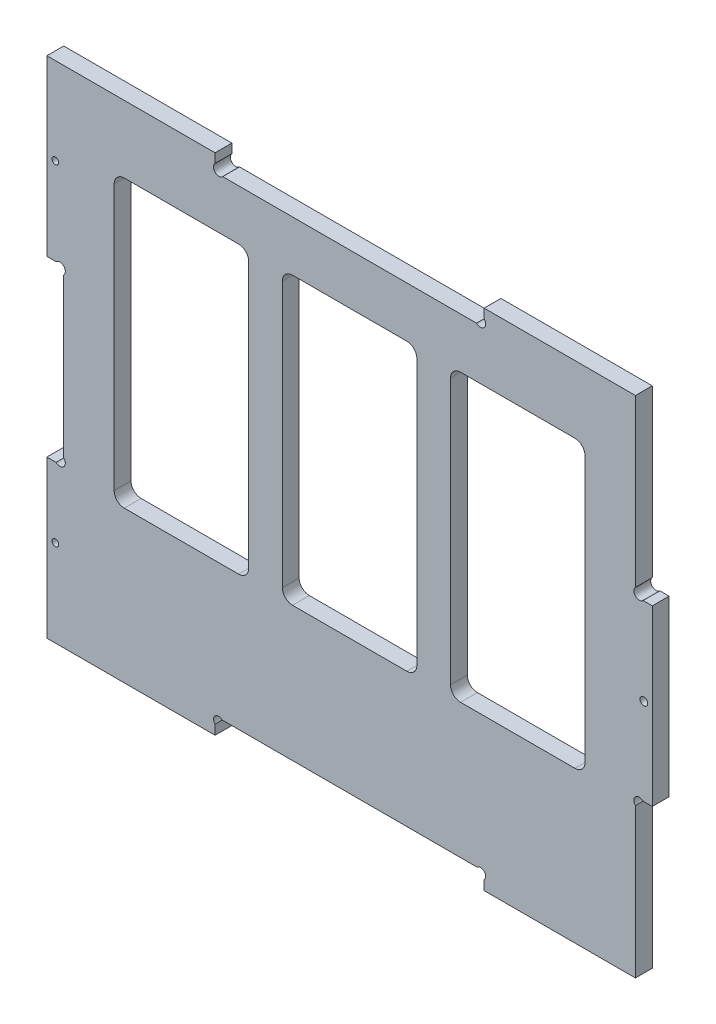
ISO-10303-21;
HEADER;
FILE_DESCRIPTION(('STEP AP214'),'2;1');
FILE_NAME('part.step','',(''),(''),'','','');
FILE_SCHEMA(('AUTOMOTIVE_DESIGN { 1 0 10303 214 1 1 1 1 }'));
ENDSEC;
DATA;
#1=APPLICATION_CONTEXT('core data for automotive mechanical design processes');
#2=APPLICATION_PROTOCOL_DEFINITION('international standard','automotive_design',2000,#1);
#3=PRODUCT_CONTEXT('',#1,'mechanical');
#4=PRODUCT('Part','Part','',(#3));
#5=PRODUCT_RELATED_PRODUCT_CATEGORY('part','',(#4));
#6=PRODUCT_DEFINITION_FORMATION('','',#4);
#7=PRODUCT_DEFINITION_CONTEXT('part definition',#1,'design');
#8=PRODUCT_DEFINITION('design','',#6,#7);
#9=PRODUCT_DEFINITION_SHAPE('','',#8);
#10=(LENGTH_UNIT() NAMED_UNIT(*) SI_UNIT(.MILLI.,.METRE.));
#11=(NAMED_UNIT(*) PLANE_ANGLE_UNIT() SI_UNIT($,.RADIAN.));
#12=(NAMED_UNIT(*) SI_UNIT($,.STERADIAN.) SOLID_ANGLE_UNIT());
#13=UNCERTAINTY_MEASURE_WITH_UNIT(LENGTH_MEASURE(1.E-05),#10,'distance_accuracy_value','');
#14=(GEOMETRIC_REPRESENTATION_CONTEXT(3) GLOBAL_UNCERTAINTY_ASSIGNED_CONTEXT((#13)) GLOBAL_UNIT_ASSIGNED_CONTEXT((#10,
#11,#12)) REPRESENTATION_CONTEXT('',''));
#15=CARTESIAN_POINT('',(0.,0.,0.));
#16=DIRECTION('',(0.,0.,1.));
#17=DIRECTION('',(1.,0.,0.));
#18=AXIS2_PLACEMENT_3D('',#15,#16,#17);
#19=CARTESIAN_POINT('',(0.,145.,5.));
#20=DIRECTION('',(0.,-1.,0.));
#21=DIRECTION('',(1.,0.,0.));
#22=AXIS2_PLACEMENT_3D('',#19,#20,#21);
#23=PLANE('',#22);
#24=DIRECTION('',(-1.,0.,0.));
#25=VECTOR('',#24,1.);
#26=CARTESIAN_POINT('',(0.,145.,5.));
#27=LINE('',#26,#25);
#28=CARTESIAN_POINT('',(50.,145.,5.));
#29=VERTEX_POINT('',#28);
#30=CARTESIAN_POINT('',(0.,145.,5.));
#31=VERTEX_POINT('',#30);
#32=EDGE_CURVE('E453',#29,#31,#27,.T.);
#33=ORIENTED_EDGE('',*,*,#32,.F.);
#34=DIRECTION('',(0.,0.,1.));
#35=VECTOR('',#34,1.);
#36=CARTESIAN_POINT('',(50.,145.,0.));
#37=LINE('',#36,#35);
#38=CARTESIAN_POINT('',(50.,145.,0.));
#39=VERTEX_POINT('',#38);
#40=EDGE_CURVE('E389',#39,#29,#37,.T.);
#41=ORIENTED_EDGE('',*,*,#40,.F.);
#42=DIRECTION('',(-1.,0.,0.));
#43=VECTOR('',#42,1.);
#44=CARTESIAN_POINT('',(0.,145.,0.));
#45=LINE('',#44,#43);
#46=CARTESIAN_POINT('',(0.,145.,0.));
#47=VERTEX_POINT('',#46);
#48=EDGE_CURVE('E477',#39,#47,#45,.T.);
#49=ORIENTED_EDGE('',*,*,#48,.T.);
#50=DIRECTION('',(0.,0.,-1.));
#51=VECTOR('',#50,1.);
#52=CARTESIAN_POINT('',(0.,145.,5.));
#53=LINE('',#52,#51);
#54=EDGE_CURVE('E457',#31,#47,#53,.T.);
#55=ORIENTED_EDGE('',*,*,#54,.F.);
#56=EDGE_LOOP('',(#33,#41,#49,#55));
#57=FACE_BOUND('',#56,.T.);
#58=ADVANCED_FACE('F32',(#57),#23,.F.);
#59=CARTESIAN_POINT('',(0.,0.,5.));
#60=DIRECTION('',(1.,0.,0.));
#61=DIRECTION('',(0.,0.,-1.));
#62=AXIS2_PLACEMENT_3D('',#59,#60,#61);
#63=PLANE('',#62);
#64=DIRECTION('',(0.,-1.,0.));
#65=VECTOR('',#64,1.);
#66=CARTESIAN_POINT('',(0.,0.,0.));
#67=LINE('',#66,#65);
#68=CARTESIAN_POINT('',(0.,93.3333333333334,0.));
#69=VERTEX_POINT('',#68);
#70=EDGE_CURVE('E482',#47,#69,#67,.T.);
#71=ORIENTED_EDGE('',*,*,#70,.T.);
#72=DIRECTION('',(0.,0.,1.));
#73=VECTOR('',#72,1.);
#74=CARTESIAN_POINT('',(0.,93.3333333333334,0.));
#75=LINE('',#74,#73);
#76=CARTESIAN_POINT('',(0.,93.3333333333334,5.));
#77=VERTEX_POINT('',#76);
#78=EDGE_CURVE('E427',#69,#77,#75,.T.);
#79=ORIENTED_EDGE('',*,*,#78,.T.);
#80=DIRECTION('',(0.,-1.,0.));
#81=VECTOR('',#80,1.);
#82=CARTESIAN_POINT('',(0.,0.,5.));
#83=LINE('',#82,#81);
#84=EDGE_CURVE('E432',#31,#77,#83,.T.);
#85=ORIENTED_EDGE('',*,*,#84,.F.);
#86=ORIENTED_EDGE('',*,*,#54,.T.);
#87=EDGE_LOOP('',(#71,#79,#85,#86));
#88=FACE_BOUND('',#87,.T.);
#89=ADVANCED_FACE('F823',(#88),#63,.F.);
#90=CARTESIAN_POINT('',(0.,-5.,5.));
#91=DIRECTION('',(0.,1.,0.));
#92=DIRECTION('',(-1.,0.,0.));
#93=AXIS2_PLACEMENT_3D('',#90,#91,#92);
#94=PLANE('',#93);
#95=DIRECTION('',(1.,0.,0.));
#96=VECTOR('',#95,1.);
#97=CARTESIAN_POINT('',(0.,-5.,0.));
#98=LINE('',#97,#96);
#99=CARTESIAN_POINT('',(0.,-5.,0.));
#100=VERTEX_POINT('',#99);
#101=CARTESIAN_POINT('',(50.,-5.00000000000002,0.));
#102=VERTEX_POINT('',#101);
#103=EDGE_CURVE('E430',#100,#102,#98,.T.);
#104=ORIENTED_EDGE('',*,*,#103,.T.);
#105=DIRECTION('',(0.,0.,-1.));
#106=VECTOR('',#105,1.);
#107=CARTESIAN_POINT('',(50.,-5.00000000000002,5.));
#108=LINE('',#107,#106);
#109=CARTESIAN_POINT('',(50.,-5.00000000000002,5.));
#110=VERTEX_POINT('',#109);
#111=EDGE_CURVE('E505',#110,#102,#108,.T.);
#112=ORIENTED_EDGE('',*,*,#111,.F.);
#113=DIRECTION('',(1.,0.,0.));
#114=VECTOR('',#113,1.);
#115=CARTESIAN_POINT('',(0.,-5.,5.));
#116=LINE('',#115,#114);
#117=CARTESIAN_POINT('',(0.,-5.,5.));
#118=VERTEX_POINT('',#117);
#119=EDGE_CURVE('E435',#118,#110,#116,.T.);
#120=ORIENTED_EDGE('',*,*,#119,.F.);
#121=DIRECTION('',(0.,0.,-1.));
#122=VECTOR('',#121,1.);
#123=CARTESIAN_POINT('',(0.,-5.,5.));
#124=LINE('',#123,#122);
#125=EDGE_CURVE('E508',#118,#100,#124,.T.);
#126=ORIENTED_EDGE('',*,*,#125,.T.);
#127=EDGE_LOOP('',(#104,#112,#120,#126));
#128=FACE_BOUND('',#127,.T.);
#129=ADVANCED_FACE('F856',(#128),#94,.F.);
#130=CARTESIAN_POINT('',(50.,-5.00000000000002,5.));
#131=DIRECTION('',(-1.,0.,0.));
#132=DIRECTION('',(0.,0.,1.));
#133=AXIS2_PLACEMENT_3D('',#130,#131,#132);
#134=PLANE('',#133);
#135=DIRECTION('',(0.,1.,0.));
#136=VECTOR('',#135,1.);
#137=CARTESIAN_POINT('',(50.,-5.00000000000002,0.));
#138=LINE('',#137,#136);
#139=CARTESIAN_POINT('',(50.,-2.12132034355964,0.));
#140=VERTEX_POINT('',#139);
#141=EDGE_CURVE('E459',#102,#140,#138,.T.);
#142=ORIENTED_EDGE('',*,*,#141,.T.);
#143=DIRECTION('',(0.,0.,-1.));
#144=VECTOR('',#143,1.);
#145=CARTESIAN_POINT('',(50.,-2.12132034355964,5.));
#146=LINE('',#145,#144);
#147=CARTESIAN_POINT('',(50.,-2.12132034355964,5.));
#148=VERTEX_POINT('',#147);
#149=EDGE_CURVE('E502',#148,#140,#146,.T.);
#150=ORIENTED_EDGE('',*,*,#149,.F.);
#151=DIRECTION('',(0.,1.,0.));
#152=VECTOR('',#151,1.);
#153=CARTESIAN_POINT('',(50.,-5.00000000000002,5.));
#154=LINE('',#153,#152);
#155=EDGE_CURVE('E438',#110,#148,#154,.T.);
#156=ORIENTED_EDGE('',*,*,#155,.F.);
#157=ORIENTED_EDGE('',*,*,#111,.T.);
#158=EDGE_LOOP('',(#142,#150,#156,#157));
#159=FACE_BOUND('',#158,.T.);
#160=ADVANCED_FACE('F862',(#159),#134,.F.);
#161=CARTESIAN_POINT('',(51.0606601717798,-1.06066017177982,5.));
#162=DIRECTION('',(0.,0.,-1.));
#163=DIRECTION('',(-1.,0.,0.));
#164=AXIS2_PLACEMENT_3D('',#161,#162,#163);
#165=CYLINDRICAL_SURFACE('',#164,1.5);
#166=CARTESIAN_POINT('',(51.0606601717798,-1.06066017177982,0.));
#167=DIRECTION('',(0.,0.,-1.));
#168=DIRECTION('',(1.,0.,0.));
#169=AXIS2_PLACEMENT_3D('',#166,#167,#168);
#170=CIRCLE('',#169,1.5);
#171=CARTESIAN_POINT('',(52.1213203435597,0.,0.));
#172=VERTEX_POINT('',#171);
#173=EDGE_CURVE('E461',#140,#172,#170,.T.);
#174=ORIENTED_EDGE('',*,*,#173,.T.);
#175=DIRECTION('',(0.,0.,-1.));
#176=VECTOR('',#175,1.);
#177=CARTESIAN_POINT('',(52.1213203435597,0.,5.));
#178=LINE('',#177,#176);
#179=CARTESIAN_POINT('',(52.1213203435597,0.,5.));
#180=VERTEX_POINT('',#179);
#181=EDGE_CURVE('E499',#180,#172,#178,.T.);
#182=ORIENTED_EDGE('',*,*,#181,.F.);
#183=CARTESIAN_POINT('',(51.0606601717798,-1.06066017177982,5.));
#184=DIRECTION('',(0.,0.,-1.));
#185=DIRECTION('',(1.,0.,0.));
#186=AXIS2_PLACEMENT_3D('',#183,#184,#185);
#187=CIRCLE('',#186,1.5);
#188=EDGE_CURVE('E440',#148,#180,#187,.T.);
#189=ORIENTED_EDGE('',*,*,#188,.F.);
#190=ORIENTED_EDGE('',*,*,#149,.T.);
#191=EDGE_LOOP('',(#174,#182,#189,#190));
#192=FACE_BOUND('',#191,.T.);
#193=ADVANCED_FACE('F864',(#192),#165,.F.);
#194=CARTESIAN_POINT('',(52.1213203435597,0.,5.));
#195=DIRECTION('',(0.,1.,0.));
#196=DIRECTION('',(0.,0.,1.));
#197=AXIS2_PLACEMENT_3D('',#194,#195,#196);
#198=PLANE('',#197);
#199=DIRECTION('',(1.,0.,0.));
#200=VECTOR('',#199,1.);
#201=CARTESIAN_POINT('',(52.1213203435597,0.,0.));
#202=LINE('',#201,#200);
#203=CARTESIAN_POINT('',(127.87867965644,0.,0.));
#204=VERTEX_POINT('',#203);
#205=EDGE_CURVE('E463',#172,#204,#202,.T.);
#206=ORIENTED_EDGE('',*,*,#205,.T.);
#207=DIRECTION('',(0.,0.,-1.));
#208=VECTOR('',#207,1.);
#209=CARTESIAN_POINT('',(127.87867965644,0.,5.));
#210=LINE('',#209,#208);
#211=CARTESIAN_POINT('',(127.87867965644,0.,5.));
#212=VERTEX_POINT('',#211);
#213=EDGE_CURVE('E496',#212,#204,#210,.T.);
#214=ORIENTED_EDGE('',*,*,#213,.F.);
#215=DIRECTION('',(1.,0.,0.));
#216=VECTOR('',#215,1.);
#217=CARTESIAN_POINT('',(52.1213203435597,0.,5.));
#218=LINE('',#217,#216);
#219=EDGE_CURVE('E442',#180,#212,#218,.T.);
#220=ORIENTED_EDGE('',*,*,#219,.F.);
#221=ORIENTED_EDGE('',*,*,#181,.T.);
#222=EDGE_LOOP('',(#206,#214,#220,#221));
#223=FACE_BOUND('',#222,.T.);
#224=ADVANCED_FACE('F869',(#223),#198,.F.);
#225=CARTESIAN_POINT('',(128.93933982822,-1.06066017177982,5.));
#226=DIRECTION('',(0.,0.,-1.));
#227=DIRECTION('',(-1.,0.,0.));
#228=AXIS2_PLACEMENT_3D('',#225,#226,#227);
#229=CYLINDRICAL_SURFACE('',#228,1.49999999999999);
#230=CARTESIAN_POINT('',(128.93933982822,-1.06066017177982,0.));
#231=DIRECTION('',(0.,0.,-1.));
#232=DIRECTION('',(1.,0.,0.));
#233=AXIS2_PLACEMENT_3D('',#230,#231,#232);
#234=CIRCLE('',#233,1.49999999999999);
#235=CARTESIAN_POINT('',(130.,-2.12132034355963,0.));
#236=VERTEX_POINT('',#235);
#237=EDGE_CURVE('E465',#204,#236,#234,.T.);
#238=ORIENTED_EDGE('',*,*,#237,.T.);
#239=DIRECTION('',(0.,0.,-1.));
#240=VECTOR('',#239,1.);
#241=CARTESIAN_POINT('',(130.,-2.12132034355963,5.));
#242=LINE('',#241,#240);
#243=CARTESIAN_POINT('',(130.,-2.12132034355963,5.));
#244=VERTEX_POINT('',#243);
#245=EDGE_CURVE('E493',#244,#236,#242,.T.);
#246=ORIENTED_EDGE('',*,*,#245,.F.);
#247=CARTESIAN_POINT('',(128.93933982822,-1.06066017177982,5.));
#248=DIRECTION('',(0.,0.,-1.));
#249=DIRECTION('',(1.,0.,0.));
#250=AXIS2_PLACEMENT_3D('',#247,#248,#249);
#251=CIRCLE('',#250,1.49999999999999);
#252=EDGE_CURVE('E444',#212,#244,#251,.T.);
#253=ORIENTED_EDGE('',*,*,#252,.F.);
#254=ORIENTED_EDGE('',*,*,#213,.T.);
#255=EDGE_LOOP('',(#238,#246,#253,#254));
#256=FACE_BOUND('',#255,.T.);
#257=ADVANCED_FACE('F875',(#256),#229,.F.);
#258=CARTESIAN_POINT('',(130.,-5.00000000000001,5.));
#259=DIRECTION('',(1.,0.,0.));
#260=DIRECTION('',(0.,0.,-1.));
#261=AXIS2_PLACEMENT_3D('',#258,#259,#260);
#262=PLANE('',#261);
#263=DIRECTION('',(0.,-1.,0.));
#264=VECTOR('',#263,1.);
#265=CARTESIAN_POINT('',(130.,-5.00000000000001,0.));
#266=LINE('',#265,#264);
#267=CARTESIAN_POINT('',(130.,-5.00000000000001,0.));
#268=VERTEX_POINT('',#267);
#269=EDGE_CURVE('E467',#236,#268,#266,.T.);
#270=ORIENTED_EDGE('',*,*,#269,.T.);
#271=DIRECTION('',(0.,0.,-1.));
#272=VECTOR('',#271,1.);
#273=CARTESIAN_POINT('',(130.,-5.00000000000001,5.));
#274=LINE('',#273,#272);
#275=CARTESIAN_POINT('',(130.,-5.00000000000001,5.));
#276=VERTEX_POINT('',#275);
#277=EDGE_CURVE('E490',#276,#268,#274,.T.);
#278=ORIENTED_EDGE('',*,*,#277,.F.);
#279=DIRECTION('',(0.,-1.,0.));
#280=VECTOR('',#279,1.);
#281=CARTESIAN_POINT('',(130.,-5.00000000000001,5.));
#282=LINE('',#281,#280);
#283=EDGE_CURVE('E446',#244,#276,#282,.T.);
#284=ORIENTED_EDGE('',*,*,#283,.F.);
#285=ORIENTED_EDGE('',*,*,#245,.T.);
#286=EDGE_LOOP('',(#270,#278,#284,#285));
#287=FACE_BOUND('',#286,.T.);
#288=ADVANCED_FACE('F879',(#287),#262,.F.);
#289=CARTESIAN_POINT('',(175.,-4.99999999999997,5.));
#290=DIRECTION('',(0.,1.,0.));
#291=DIRECTION('',(-1.,0.,0.));
#292=AXIS2_PLACEMENT_3D('',#289,#290,#291);
#293=PLANE('',#292);
#294=DIRECTION('',(1.,0.,0.));
#295=VECTOR('',#294,1.);
#296=CARTESIAN_POINT('',(175.,-4.99999999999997,0.));
#297=LINE('',#296,#295);
#298=CARTESIAN_POINT('',(175.,-4.99999999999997,0.));
#299=VERTEX_POINT('',#298);
#300=EDGE_CURVE('E469',#268,#299,#297,.T.);
#301=ORIENTED_EDGE('',*,*,#300,.T.);
#302=DIRECTION('',(0.,0.,-1.));
#303=VECTOR('',#302,1.);
#304=CARTESIAN_POINT('',(175.,-4.99999999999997,5.));
#305=LINE('',#304,#303);
#306=CARTESIAN_POINT('',(175.,-4.99999999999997,5.));
#307=VERTEX_POINT('',#306);
#308=EDGE_CURVE('E487',#307,#299,#305,.T.);
#309=ORIENTED_EDGE('',*,*,#308,.F.);
#310=DIRECTION('',(1.,0.,0.));
#311=VECTOR('',#310,1.);
#312=CARTESIAN_POINT('',(175.,-4.99999999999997,5.));
#313=LINE('',#312,#311);
#314=EDGE_CURVE('E448',#276,#307,#313,.T.);
#315=ORIENTED_EDGE('',*,*,#314,.F.);
#316=ORIENTED_EDGE('',*,*,#277,.T.);
#317=EDGE_LOOP('',(#301,#309,#315,#316));
#318=FACE_BOUND('',#317,.T.);
#319=ADVANCED_FACE('F884',(#318),#293,.F.);
#320=CARTESIAN_POINT('',(175.,-4.99999999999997,5.));
#321=DIRECTION('',(-1.,0.,0.));
#322=DIRECTION('',(0.,0.,1.));
#323=AXIS2_PLACEMENT_3D('',#320,#321,#322);
#324=PLANE('',#323);
#325=DIRECTION('',(0.,1.,0.));
#326=VECTOR('',#325,1.);
#327=CARTESIAN_POINT('',(175.,-4.99999999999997,0.));
#328=LINE('',#327,#326);
#329=CARTESIAN_POINT('',(175.,39.4039249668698,0.));
#330=VERTEX_POINT('',#329);
#331=EDGE_CURVE('E471',#299,#330,#328,.T.);
#332=ORIENTED_EDGE('',*,*,#331,.T.);
#333=DIRECTION('',(0.,0.,1.));
#334=VECTOR('',#333,1.);
#335=CARTESIAN_POINT('',(175.,39.4039249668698,0.));
#336=LINE('',#335,#334);
#337=CARTESIAN_POINT('',(175.,39.4039249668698,5.));
#338=VERTEX_POINT('',#337);
#339=EDGE_CURVE('E728',#330,#338,#336,.T.);
#340=ORIENTED_EDGE('',*,*,#339,.T.);
#341=DIRECTION('',(0.,1.,0.));
#342=VECTOR('',#341,1.);
#343=CARTESIAN_POINT('',(175.,-4.99999999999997,5.));
#344=LINE('',#343,#342);
#345=EDGE_CURVE('E370',#307,#338,#344,.T.);
#346=ORIENTED_EDGE('',*,*,#345,.F.);
#347=ORIENTED_EDGE('',*,*,#308,.T.);
#348=EDGE_LOOP('',(#332,#340,#346,#347));
#349=FACE_BOUND('',#348,.T.);
#350=ADVANCED_FACE('F887',(#349),#324,.F.);
#351=CARTESIAN_POINT('',(180.,0.,5.));
#352=DIRECTION('',(-1.,0.,0.));
#353=DIRECTION('',(0.,-1.,0.));
#354=AXIS2_PLACEMENT_3D('',#351,#352,#353);
#355=PLANE('',#354);
#356=DIRECTION('',(0.,1.,0.));
#357=VECTOR('',#356,1.);
#358=CARTESIAN_POINT('',(180.,0.,5.));
#359=LINE('',#358,#357);
#360=CARTESIAN_POINT('',(180.,41.6666666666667,5.));
#361=VERTEX_POINT('',#360);
#362=CARTESIAN_POINT('',(180.,93.3333333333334,5.));
#363=VERTEX_POINT('',#362);
#364=EDGE_CURVE('E451',#361,#363,#359,.T.);
#365=ORIENTED_EDGE('',*,*,#364,.F.);
#366=DIRECTION('',(0.,0.,1.));
#367=VECTOR('',#366,1.);
#368=CARTESIAN_POINT('',(180.,41.6666666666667,0.));
#369=LINE('',#368,#367);
#370=CARTESIAN_POINT('',(180.,41.6666666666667,0.));
#371=VERTEX_POINT('',#370);
#372=EDGE_CURVE('E387',#371,#361,#369,.T.);
#373=ORIENTED_EDGE('',*,*,#372,.F.);
#374=DIRECTION('',(0.,1.,0.));
#375=VECTOR('',#374,1.);
#376=CARTESIAN_POINT('',(180.,0.,0.));
#377=LINE('',#376,#375);
#378=CARTESIAN_POINT('',(180.,93.3333333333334,0.));
#379=VERTEX_POINT('',#378);
#380=EDGE_CURVE('E474',#371,#379,#377,.T.);
#381=ORIENTED_EDGE('',*,*,#380,.T.);
#382=DIRECTION('',(0.,0.,1.));
#383=VECTOR('',#382,1.);
#384=CARTESIAN_POINT('',(180.,93.3333333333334,0.));
#385=LINE('',#384,#383);
#386=EDGE_CURVE('E404',#379,#363,#385,.T.);
#387=ORIENTED_EDGE('',*,*,#386,.T.);
#388=EDGE_LOOP('',(#365,#373,#381,#387));
#389=FACE_BOUND('',#388,.T.);
#390=ADVANCED_FACE('F890',(#389),#355,.F.);
#391=CARTESIAN_POINT('',(175.,145.,0.));
#392=VERTEX_POINT('',#391);
#393=CARTESIAN_POINT('',(130.,145.,0.));
#394=VERTEX_POINT('',#393);
#395=EDGE_CURVE('E478',#392,#394,#45,.T.);
#396=ORIENTED_EDGE('',*,*,#395,.T.);
#397=DIRECTION('',(0.,0.,1.));
#398=VECTOR('',#397,1.);
#399=CARTESIAN_POINT('',(130.,145.,0.));
#400=LINE('',#399,#398);
#401=CARTESIAN_POINT('',(130.,145.,5.));
#402=VERTEX_POINT('',#401);
#403=EDGE_CURVE('E392',#394,#402,#400,.T.);
#404=ORIENTED_EDGE('',*,*,#403,.T.);
#405=CARTESIAN_POINT('',(175.,145.,5.));
#406=VERTEX_POINT('',#405);
#407=EDGE_CURVE('E454',#406,#402,#27,.T.);
#408=ORIENTED_EDGE('',*,*,#407,.F.);
#409=DIRECTION('',(0.,0.,1.));
#410=VECTOR('',#409,1.);
#411=CARTESIAN_POINT('',(175.,145.,0.));
#412=LINE('',#411,#410);
#413=EDGE_CURVE('E408',#392,#406,#412,.T.);
#414=ORIENTED_EDGE('',*,*,#413,.F.);
#415=EDGE_LOOP('',(#396,#404,#408,#414));
#416=FACE_BOUND('',#415,.T.);
#417=ADVANCED_FACE('F788',(#416),#23,.F.);
#418=CARTESIAN_POINT('',(0.,41.6666666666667,5.));
#419=VERTEX_POINT('',#418);
#420=EDGE_CURVE('E436',#419,#118,#83,.T.);
#421=ORIENTED_EDGE('',*,*,#420,.F.);
#422=DIRECTION('',(0.,0.,1.));
#423=VECTOR('',#422,1.);
#424=CARTESIAN_POINT('',(0.,41.6666666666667,0.));
#425=LINE('',#424,#423);
#426=CARTESIAN_POINT('',(0.,41.6666666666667,0.));
#427=VERTEX_POINT('',#426);
#428=EDGE_CURVE('E421',#427,#419,#425,.T.);
#429=ORIENTED_EDGE('',*,*,#428,.F.);
#430=EDGE_CURVE('E481',#427,#100,#67,.T.);
#431=ORIENTED_EDGE('',*,*,#430,.T.);
#432=ORIENTED_EDGE('',*,*,#125,.F.);
#433=EDGE_LOOP('',(#421,#429,#431,#432));
#434=FACE_BOUND('',#433,.T.);
#435=ADVANCED_FACE('F848',(#434),#63,.F.);
#436=CARTESIAN_POINT('',(51.0606601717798,-1.06066017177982,5.));
#437=DIRECTION('',(0.,0.,1.));
#438=DIRECTION('',(1.,0.,0.));
#439=AXIS2_PLACEMENT_3D('',#436,#437,#438);
#440=PLANE('',#439);
#441=DIRECTION('',(0.,-1.,0.));
#442=VECTOR('',#441,1.);
#443=CARTESIAN_POINT('',(120.,125.,5.));
#444=LINE('',#443,#442);
#445=CARTESIAN_POINT('',(120.,122.,5.));
#446=VERTEX_POINT('',#445);
#447=CARTESIAN_POINT('',(120.,43.,5.));
#448=VERTEX_POINT('',#447);
#449=EDGE_CURVE('E1025',#446,#448,#444,.T.);
#450=ORIENTED_EDGE('',*,*,#449,.F.);
#451=CARTESIAN_POINT('',(123.,122.,5.));
#452=DIRECTION('',(0.,0.,1.));
#453=DIRECTION('',(1.,0.,0.));
#454=AXIS2_PLACEMENT_3D('',#451,#452,#453);
#455=CIRCLE('',#454,3.);
#456=CARTESIAN_POINT('',(123.,125.,5.));
#457=VERTEX_POINT('',#456);
#458=EDGE_CURVE('E661',#446,#457,#455,.F.);
#459=ORIENTED_EDGE('',*,*,#458,.T.);
#460=DIRECTION('',(-1.,0.,0.));
#461=VECTOR('',#460,1.);
#462=CARTESIAN_POINT('',(120.,125.,5.));
#463=LINE('',#462,#461);
#464=CARTESIAN_POINT('',(157.,125.,5.));
#465=VERTEX_POINT('',#464);
#466=EDGE_CURVE('E1013',#465,#457,#463,.T.);
#467=ORIENTED_EDGE('',*,*,#466,.F.);
#468=CARTESIAN_POINT('',(157.,122.,5.));
#469=DIRECTION('',(0.,0.,1.));
#470=DIRECTION('',(1.,0.,0.));
#471=AXIS2_PLACEMENT_3D('',#468,#469,#470);
#472=CIRCLE('',#471,3.);
#473=CARTESIAN_POINT('',(160.,122.,5.));
#474=VERTEX_POINT('',#473);
#475=EDGE_CURVE('E650',#465,#474,#472,.F.);
#476=ORIENTED_EDGE('',*,*,#475,.T.);
#477=DIRECTION('',(0.,1.,0.));
#478=VECTOR('',#477,1.);
#479=CARTESIAN_POINT('',(160.,125.,5.));
#480=LINE('',#479,#478);
#481=CARTESIAN_POINT('',(160.,43.,5.));
#482=VERTEX_POINT('',#481);
#483=EDGE_CURVE('E1017',#482,#474,#480,.T.);
#484=ORIENTED_EDGE('',*,*,#483,.F.);
#485=CARTESIAN_POINT('',(157.,43.,5.));
#486=DIRECTION('',(0.,0.,1.));
#487=DIRECTION('',(1.,0.,0.));
#488=AXIS2_PLACEMENT_3D('',#485,#486,#487);
#489=CIRCLE('',#488,3.);
#490=CARTESIAN_POINT('',(157.,40.,5.));
#491=VERTEX_POINT('',#490);
#492=EDGE_CURVE('E626',#482,#491,#489,.F.);
#493=ORIENTED_EDGE('',*,*,#492,.T.);
#494=DIRECTION('',(1.,0.,0.));
#495=VECTOR('',#494,1.);
#496=CARTESIAN_POINT('',(120.,40.,5.));
#497=LINE('',#496,#495);
#498=CARTESIAN_POINT('',(123.,40.,5.));
#499=VERTEX_POINT('',#498);
#500=EDGE_CURVE('E1022',#499,#491,#497,.T.);
#501=ORIENTED_EDGE('',*,*,#500,.F.);
#502=CARTESIAN_POINT('',(123.,43.,5.));
#503=DIRECTION('',(0.,0.,1.));
#504=DIRECTION('',(1.,0.,0.));
#505=AXIS2_PLACEMENT_3D('',#502,#503,#504);
#506=CIRCLE('',#505,3.);
#507=EDGE_CURVE('E646',#499,#448,#506,.F.);
#508=ORIENTED_EDGE('',*,*,#507,.T.);
#509=EDGE_LOOP('',(#450,#459,#467,#476,#484,#493,#501,#508));
#510=FACE_BOUND('',#509,.T.);
#511=DIRECTION('',(0.,-1.,0.));
#512=VECTOR('',#511,1.);
#513=CARTESIAN_POINT('',(70.,125.,5.));
#514=LINE('',#513,#512);
#515=CARTESIAN_POINT('',(70.,122.,5.));
#516=VERTEX_POINT('',#515);
#517=CARTESIAN_POINT('',(70.,43.,5.));
#518=VERTEX_POINT('',#517);
#519=EDGE_CURVE('E990',#516,#518,#514,.T.);
#520=ORIENTED_EDGE('',*,*,#519,.F.);
#521=CARTESIAN_POINT('',(73.,122.,5.));
#522=DIRECTION('',(0.,0.,1.));
#523=DIRECTION('',(1.,0.,0.));
#524=AXIS2_PLACEMENT_3D('',#521,#522,#523);
#525=CIRCLE('',#524,3.);
#526=CARTESIAN_POINT('',(73.,125.,5.));
#527=VERTEX_POINT('',#526);
#528=EDGE_CURVE('E665',#516,#527,#525,.F.);
#529=ORIENTED_EDGE('',*,*,#528,.T.);
#530=DIRECTION('',(-1.,0.,0.));
#531=VECTOR('',#530,1.);
#532=CARTESIAN_POINT('',(70.,125.,5.));
#533=LINE('',#532,#531);
#534=CARTESIAN_POINT('',(107.,125.,5.));
#535=VERTEX_POINT('',#534);
#536=EDGE_CURVE('E711',#535,#527,#533,.T.);
#537=ORIENTED_EDGE('',*,*,#536,.F.);
#538=CARTESIAN_POINT('',(107.,122.,5.));
#539=DIRECTION('',(0.,0.,1.));
#540=DIRECTION('',(1.,0.,0.));
#541=AXIS2_PLACEMENT_3D('',#538,#539,#540);
#542=CIRCLE('',#541,3.);
#543=CARTESIAN_POINT('',(110.,122.,5.));
#544=VERTEX_POINT('',#543);
#545=EDGE_CURVE('E654',#535,#544,#542,.F.);
#546=ORIENTED_EDGE('',*,*,#545,.T.);
#547=DIRECTION('',(0.,1.,0.));
#548=VECTOR('',#547,1.);
#549=CARTESIAN_POINT('',(110.,125.,5.));
#550=LINE('',#549,#548);
#551=CARTESIAN_POINT('',(110.,43.,5.));
#552=VERTEX_POINT('',#551);
#553=EDGE_CURVE('E714',#552,#544,#550,.T.);
#554=ORIENTED_EDGE('',*,*,#553,.F.);
#555=CARTESIAN_POINT('',(107.,43.,5.));
#556=DIRECTION('',(0.,0.,1.));
#557=DIRECTION('',(1.,0.,0.));
#558=AXIS2_PLACEMENT_3D('',#555,#556,#557);
#559=CIRCLE('',#558,3.);
#560=CARTESIAN_POINT('',(107.,40.,5.));
#561=VERTEX_POINT('',#560);
#562=EDGE_CURVE('E630',#552,#561,#559,.F.);
#563=ORIENTED_EDGE('',*,*,#562,.T.);
#564=DIRECTION('',(1.,0.,0.));
#565=VECTOR('',#564,1.);
#566=CARTESIAN_POINT('',(70.,40.,5.));
#567=LINE('',#566,#565);
#568=CARTESIAN_POINT('',(73.,40.,5.));
#569=VERTEX_POINT('',#568);
#570=EDGE_CURVE('E999',#569,#561,#567,.T.);
#571=ORIENTED_EDGE('',*,*,#570,.F.);
#572=CARTESIAN_POINT('',(73.,43.,5.));
#573=DIRECTION('',(0.,0.,1.));
#574=DIRECTION('',(1.,0.,0.));
#575=AXIS2_PLACEMENT_3D('',#572,#573,#574);
#576=CIRCLE('',#575,3.);
#577=EDGE_CURVE('E642',#569,#518,#576,.F.);
#578=ORIENTED_EDGE('',*,*,#577,.T.);
#579=EDGE_LOOP('',(#520,#529,#537,#546,#554,#563,#571,#578));
#580=FACE_BOUND('',#579,.T.);
#581=DIRECTION('',(0.,1.,0.));
#582=VECTOR('',#581,1.);
#583=CARTESIAN_POINT('',(60.,125.,5.));
#584=LINE('',#583,#582);
#585=CARTESIAN_POINT('',(60.,43.,5.));
#586=VERTEX_POINT('',#585);
#587=CARTESIAN_POINT('',(60.,122.,5.));
#588=VERTEX_POINT('',#587);
#589=EDGE_CURVE('E680',#586,#588,#584,.T.);
#590=ORIENTED_EDGE('',*,*,#589,.F.);
#591=CARTESIAN_POINT('',(57.,43.,5.));
#592=DIRECTION('',(0.,0.,1.));
#593=DIRECTION('',(1.,0.,0.));
#594=AXIS2_PLACEMENT_3D('',#591,#592,#593);
#595=CIRCLE('',#594,3.);
#596=CARTESIAN_POINT('',(57.,40.,5.));
#597=VERTEX_POINT('',#596);
#598=EDGE_CURVE('E634',#586,#597,#595,.F.);
#599=ORIENTED_EDGE('',*,*,#598,.T.);
#600=DIRECTION('',(1.,0.,0.));
#601=VECTOR('',#600,1.);
#602=CARTESIAN_POINT('',(20.,40.,5.));
#603=LINE('',#602,#601);
#604=CARTESIAN_POINT('',(23.,40.,5.));
#605=VERTEX_POINT('',#604);
#606=EDGE_CURVE('E700',#605,#597,#603,.T.);
#607=ORIENTED_EDGE('',*,*,#606,.F.);
#608=CARTESIAN_POINT('',(23.,43.,5.));
#609=DIRECTION('',(0.,0.,1.));
#610=DIRECTION('',(1.,0.,0.));
#611=AXIS2_PLACEMENT_3D('',#608,#609,#610);
#612=CIRCLE('',#611,3.);
#613=CARTESIAN_POINT('',(20.,43.,5.));
#614=VERTEX_POINT('',#613);
#615=EDGE_CURVE('E638',#605,#614,#612,.F.);
#616=ORIENTED_EDGE('',*,*,#615,.T.);
#617=DIRECTION('',(0.,-1.,0.));
#618=VECTOR('',#617,1.);
#619=CARTESIAN_POINT('',(20.,125.,5.));
#620=LINE('',#619,#618);
#621=CARTESIAN_POINT('',(20.,122.,5.));
#622=VERTEX_POINT('',#621);
#623=EDGE_CURVE('E675',#622,#614,#620,.T.);
#624=ORIENTED_EDGE('',*,*,#623,.F.);
#625=CARTESIAN_POINT('',(23.,122.,5.));
#626=DIRECTION('',(0.,0.,1.));
#627=DIRECTION('',(1.,0.,0.));
#628=AXIS2_PLACEMENT_3D('',#625,#626,#627);
#629=CIRCLE('',#628,3.);
#630=CARTESIAN_POINT('',(23.,125.,5.));
#631=VERTEX_POINT('',#630);
#632=EDGE_CURVE('E40',#622,#631,#629,.F.);
#633=ORIENTED_EDGE('',*,*,#632,.T.);
#634=DIRECTION('',(-1.,0.,0.));
#635=VECTOR('',#634,1.);
#636=CARTESIAN_POINT('',(20.,125.,5.));
#637=LINE('',#636,#635);
#638=CARTESIAN_POINT('',(57.,125.,5.));
#639=VERTEX_POINT('',#638);
#640=EDGE_CURVE('E673',#639,#631,#637,.T.);
#641=ORIENTED_EDGE('',*,*,#640,.F.);
#642=CARTESIAN_POINT('',(57.,122.,5.));
#643=DIRECTION('',(0.,0.,1.));
#644=DIRECTION('',(1.,0.,0.));
#645=AXIS2_PLACEMENT_3D('',#642,#643,#644);
#646=CIRCLE('',#645,3.);
#647=EDGE_CURVE('E658',#639,#588,#646,.F.);
#648=ORIENTED_EDGE('',*,*,#647,.T.);
#649=EDGE_LOOP('',(#590,#599,#607,#616,#624,#633,#641,#648));
#650=FACE_BOUND('',#649,.T.);
#651=CARTESIAN_POINT('',(2.5,119.166666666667,5.));
#652=DIRECTION('',(0.,0.,1.));
#653=DIRECTION('',(1.,0.,0.));
#654=AXIS2_PLACEMENT_3D('',#651,#652,#653);
#655=CIRCLE('',#654,1.);
#656=CARTESIAN_POINT('',(3.5,119.166666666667,5.));
#657=VERTEX_POINT('',#656);
#658=EDGE_CURVE('E533',#657,#657,#655,.T.);
#659=ORIENTED_EDGE('',*,*,#658,.F.);
#660=EDGE_LOOP('',(#659));
#661=FACE_BOUND('',#660,.T.);
#662=CARTESIAN_POINT('',(2.5,20.8333333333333,5.));
#663=DIRECTION('',(0.,0.,1.));
#664=DIRECTION('',(1.,0.,0.));
#665=AXIS2_PLACEMENT_3D('',#662,#663,#664);
#666=CIRCLE('',#665,1.);
#667=CARTESIAN_POINT('',(3.50000000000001,20.8333333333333,5.));
#668=VERTEX_POINT('',#667);
#669=EDGE_CURVE('E529',#668,#668,#666,.T.);
#670=ORIENTED_EDGE('',*,*,#669,.F.);
#671=EDGE_LOOP('',(#670));
#672=FACE_BOUND('',#671,.T.);
#673=CARTESIAN_POINT('',(177.5,67.5,5.));
#674=DIRECTION('',(0.,0.,1.));
#675=DIRECTION('',(1.,0.,0.));
#676=AXIS2_PLACEMENT_3D('',#673,#674,#675);
#677=CIRCLE('',#676,1.15000000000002);
#678=CARTESIAN_POINT('',(178.65,67.5,5.));
#679=VERTEX_POINT('',#678);
#680=EDGE_CURVE('E528',#679,#679,#677,.T.);
#681=ORIENTED_EDGE('',*,*,#680,.F.);
#682=EDGE_LOOP('',(#681));
#683=FACE_BOUND('',#682,.T.);
#684=CARTESIAN_POINT('',(176.131370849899,40.5352958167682,5.));
#685=DIRECTION('',(0.,0.,1.));
#686=DIRECTION('',(1.,0.,0.));
#687=AXIS2_PLACEMENT_3D('',#684,#685,#686);
#688=CIRCLE('',#687,1.59999999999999);
#689=CARTESIAN_POINT('',(177.262741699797,41.6666666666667,5.));
#690=VERTEX_POINT('',#689);
#691=EDGE_CURVE('E362',#690,#338,#688,.T.);
#692=ORIENTED_EDGE('',*,*,#691,.F.);
#693=DIRECTION('',(-1.,0.,0.));
#694=VECTOR('',#693,1.);
#695=CARTESIAN_POINT('',(180.,41.6666666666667,5.));
#696=LINE('',#695,#694);
#697=EDGE_CURVE('E367',#361,#690,#696,.T.);
#698=ORIENTED_EDGE('',*,*,#697,.F.);
#699=ORIENTED_EDGE('',*,*,#364,.T.);
#700=DIRECTION('',(1.,0.,0.));
#701=VECTOR('',#700,1.);
#702=CARTESIAN_POINT('',(175.,93.3333333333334,5.));
#703=LINE('',#702,#701);
#704=CARTESIAN_POINT('',(177.262741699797,93.3333333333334,5.));
#705=VERTEX_POINT('',#704);
#706=EDGE_CURVE('E402',#705,#363,#703,.T.);
#707=ORIENTED_EDGE('',*,*,#706,.F.);
#708=CARTESIAN_POINT('',(176.131370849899,94.4647041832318,5.));
#709=DIRECTION('',(0.,0.,1.));
#710=DIRECTION('',(1.,0.,0.));
#711=AXIS2_PLACEMENT_3D('',#708,#709,#710);
#712=CIRCLE('',#711,1.59999999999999);
#713=CARTESIAN_POINT('',(175.,95.5960750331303,5.));
#714=VERTEX_POINT('',#713);
#715=EDGE_CURVE('E731',#714,#705,#712,.T.);
#716=ORIENTED_EDGE('',*,*,#715,.F.);
#717=DIRECTION('',(0.,-1.,0.));
#718=VECTOR('',#717,1.);
#719=CARTESIAN_POINT('',(175.,145.,5.));
#720=LINE('',#719,#718);
#721=EDGE_CURVE('E397',#406,#714,#720,.T.);
#722=ORIENTED_EDGE('',*,*,#721,.F.);
#723=ORIENTED_EDGE('',*,*,#407,.T.);
#724=DIRECTION('',(0.,1.,0.));
#725=VECTOR('',#724,1.);
#726=CARTESIAN_POINT('',(130.,145.,5.));
#727=LINE('',#726,#725);
#728=CARTESIAN_POINT('',(130.,142.262741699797,5.));
#729=VERTEX_POINT('',#728);
#730=EDGE_CURVE('E774',#729,#402,#727,.T.);
#731=ORIENTED_EDGE('',*,*,#730,.F.);
#732=CARTESIAN_POINT('',(128.868629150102,141.131370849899,5.));
#733=DIRECTION('',(0.,0.,1.));
#734=DIRECTION('',(1.,0.,0.));
#735=AXIS2_PLACEMENT_3D('',#732,#733,#734);
#736=CIRCLE('',#735,1.59999999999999);
#737=CARTESIAN_POINT('',(127.737258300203,140.,5.));
#738=VERTEX_POINT('',#737);
#739=EDGE_CURVE('E754',#738,#729,#736,.T.);
#740=ORIENTED_EDGE('',*,*,#739,.F.);
#741=DIRECTION('',(1.,0.,0.));
#742=VECTOR('',#741,1.);
#743=CARTESIAN_POINT('',(50.,140.,5.));
#744=LINE('',#743,#742);
#745=CARTESIAN_POINT('',(52.2627416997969,140.,5.));
#746=VERTEX_POINT('',#745);
#747=EDGE_CURVE('E781',#746,#738,#744,.T.);
#748=ORIENTED_EDGE('',*,*,#747,.F.);
#749=CARTESIAN_POINT('',(51.1313708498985,141.131370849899,5.));
#750=DIRECTION('',(0.,0.,1.));
#751=DIRECTION('',(1.,0.,0.));
#752=AXIS2_PLACEMENT_3D('',#749,#750,#751);
#753=CIRCLE('',#752,1.6);
#754=CARTESIAN_POINT('',(50.,142.262741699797,5.));
#755=VERTEX_POINT('',#754);
#756=EDGE_CURVE('E762',#755,#746,#753,.T.);
#757=ORIENTED_EDGE('',*,*,#756,.F.);
#758=DIRECTION('',(0.,-1.,0.));
#759=VECTOR('',#758,1.);
#760=CARTESIAN_POINT('',(50.,145.,5.));
#761=LINE('',#760,#759);
#762=EDGE_CURVE('E769',#29,#755,#761,.T.);
#763=ORIENTED_EDGE('',*,*,#762,.F.);
#764=ORIENTED_EDGE('',*,*,#32,.T.);
#765=ORIENTED_EDGE('',*,*,#84,.T.);
#766=DIRECTION('',(-1.,0.,0.));
#767=VECTOR('',#766,1.);
#768=CARTESIAN_POINT('',(0.,93.3333333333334,5.));
#769=LINE('',#768,#767);
#770=CARTESIAN_POINT('',(2.73725830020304,93.3333333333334,5.));
#771=VERTEX_POINT('',#770);
#772=EDGE_CURVE('E417',#771,#77,#769,.T.);
#773=ORIENTED_EDGE('',*,*,#772,.F.);
#774=CARTESIAN_POINT('',(3.86862915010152,92.2019624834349,5.));
#775=DIRECTION('',(0.,0.,1.));
#776=DIRECTION('',(1.,0.,0.));
#777=AXIS2_PLACEMENT_3D('',#774,#775,#776);
#778=CIRCLE('',#777,1.6);
#779=CARTESIAN_POINT('',(5.,91.0705916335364,5.));
#780=VERTEX_POINT('',#779);
#781=EDGE_CURVE('E746',#780,#771,#778,.T.);
#782=ORIENTED_EDGE('',*,*,#781,.F.);
#783=DIRECTION('',(0.,1.,0.));
#784=VECTOR('',#783,1.);
#785=CARTESIAN_POINT('',(5.,93.3333333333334,5.));
#786=LINE('',#785,#784);
#787=CARTESIAN_POINT('',(5.00000000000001,43.9294083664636,5.));
#788=VERTEX_POINT('',#787);
#789=EDGE_CURVE('E424',#788,#780,#786,.T.);
#790=ORIENTED_EDGE('',*,*,#789,.F.);
#791=CARTESIAN_POINT('',(3.86862915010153,42.7980375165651,5.));
#792=DIRECTION('',(0.,0.,1.));
#793=DIRECTION('',(1.,0.,0.));
#794=AXIS2_PLACEMENT_3D('',#791,#792,#793);
#795=CIRCLE('',#794,1.60000000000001);
#796=CARTESIAN_POINT('',(2.73725830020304,41.6666666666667,5.));
#797=VERTEX_POINT('',#796);
#798=EDGE_CURVE('E738',#797,#788,#795,.T.);
#799=ORIENTED_EDGE('',*,*,#798,.F.);
#800=DIRECTION('',(1.,0.,0.));
#801=VECTOR('',#800,1.);
#802=CARTESIAN_POINT('',(0.,41.6666666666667,5.));
#803=LINE('',#802,#801);
#804=EDGE_CURVE('E410',#419,#797,#803,.T.);
#805=ORIENTED_EDGE('',*,*,#804,.F.);
#806=ORIENTED_EDGE('',*,*,#420,.T.);
#807=ORIENTED_EDGE('',*,*,#119,.T.);
#808=ORIENTED_EDGE('',*,*,#155,.T.);
#809=ORIENTED_EDGE('',*,*,#188,.T.);
#810=ORIENTED_EDGE('',*,*,#219,.T.);
#811=ORIENTED_EDGE('',*,*,#252,.T.);
#812=ORIENTED_EDGE('',*,*,#283,.T.);
#813=ORIENTED_EDGE('',*,*,#314,.T.);
#814=ORIENTED_EDGE('',*,*,#345,.T.);
#815=EDGE_LOOP('',(#692,#698,#699,#707,#716,#722,#723,#731,#740,#748,#757,#763,#764,#765,#773,
#782,#790,#799,#805,#806,#807,#808,#809,#810,#811,#812,#813,#814));
#816=FACE_BOUND('',#815,.T.);
#817=ADVANCED_FACE('F364',(#510,#580,#650,#661,#672,#683,#816),#440,.T.);
#818=CARTESIAN_POINT('',(51.0606601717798,-1.06066017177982,0.));
#819=DIRECTION('',(0.,0.,1.));
#820=DIRECTION('',(1.,0.,0.));
#821=AXIS2_PLACEMENT_3D('',#818,#819,#820);
#822=PLANE('',#821);
#823=DIRECTION('',(0.,1.,0.));
#824=VECTOR('',#823,1.);
#825=CARTESIAN_POINT('',(160.,-1.06066017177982,0.));
#826=LINE('',#825,#824);
#827=CARTESIAN_POINT('',(160.,43.,0.));
#828=VERTEX_POINT('',#827);
#829=CARTESIAN_POINT('',(160.,122.,0.));
#830=VERTEX_POINT('',#829);
#831=EDGE_CURVE('E558',#828,#830,#826,.T.);
#832=ORIENTED_EDGE('',*,*,#831,.T.);
#833=CARTESIAN_POINT('',(157.,122.,0.));
#834=DIRECTION('',(0.,0.,1.));
#835=DIRECTION('',(1.,0.,0.));
#836=AXIS2_PLACEMENT_3D('',#833,#834,#835);
#837=CIRCLE('',#836,3.);
#838=CARTESIAN_POINT('',(157.,125.,0.));
#839=VERTEX_POINT('',#838);
#840=EDGE_CURVE('E652',#830,#839,#837,.T.);
#841=ORIENTED_EDGE('',*,*,#840,.T.);
#842=DIRECTION('',(-1.,0.,0.));
#843=VECTOR('',#842,1.);
#844=CARTESIAN_POINT('',(51.0606601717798,125.,0.));
#845=LINE('',#844,#843);
#846=CARTESIAN_POINT('',(123.,125.,0.));
#847=VERTEX_POINT('',#846);
#848=EDGE_CURVE('E561',#839,#847,#845,.T.);
#849=ORIENTED_EDGE('',*,*,#848,.T.);
#850=CARTESIAN_POINT('',(123.,122.,0.));
#851=DIRECTION('',(0.,0.,1.));
#852=DIRECTION('',(1.,0.,0.));
#853=AXIS2_PLACEMENT_3D('',#850,#851,#852);
#854=CIRCLE('',#853,3.);
#855=CARTESIAN_POINT('',(120.,122.,0.));
#856=VERTEX_POINT('',#855);
#857=EDGE_CURVE('E663',#847,#856,#854,.T.);
#858=ORIENTED_EDGE('',*,*,#857,.T.);
#859=DIRECTION('',(0.,-1.,0.));
#860=VECTOR('',#859,1.);
#861=CARTESIAN_POINT('',(120.,-1.06066017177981,0.));
#862=LINE('',#861,#860);
#863=CARTESIAN_POINT('',(120.,43.,0.));
#864=VERTEX_POINT('',#863);
#865=EDGE_CURVE('E564',#856,#864,#862,.T.);
#866=ORIENTED_EDGE('',*,*,#865,.T.);
#867=CARTESIAN_POINT('',(123.,43.,0.));
#868=DIRECTION('',(0.,0.,1.));
#869=DIRECTION('',(1.,0.,0.));
#870=AXIS2_PLACEMENT_3D('',#867,#868,#869);
#871=CIRCLE('',#870,3.);
#872=CARTESIAN_POINT('',(123.,40.,0.));
#873=VERTEX_POINT('',#872);
#874=EDGE_CURVE('E648',#864,#873,#871,.T.);
#875=ORIENTED_EDGE('',*,*,#874,.T.);
#876=DIRECTION('',(1.,0.,0.));
#877=VECTOR('',#876,1.);
#878=CARTESIAN_POINT('',(51.0606601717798,40.,0.));
#879=LINE('',#878,#877);
#880=CARTESIAN_POINT('',(157.,40.,0.));
#881=VERTEX_POINT('',#880);
#882=EDGE_CURVE('E555',#873,#881,#879,.T.);
#883=ORIENTED_EDGE('',*,*,#882,.T.);
#884=CARTESIAN_POINT('',(157.,43.,0.));
#885=DIRECTION('',(0.,0.,1.));
#886=DIRECTION('',(1.,0.,0.));
#887=AXIS2_PLACEMENT_3D('',#884,#885,#886);
#888=CIRCLE('',#887,3.);
#889=EDGE_CURVE('E628',#881,#828,#888,.T.);
#890=ORIENTED_EDGE('',*,*,#889,.T.);
#891=EDGE_LOOP('',(#832,#841,#849,#858,#866,#875,#883,#890));
#892=FACE_BOUND('',#891,.T.);
#893=DIRECTION('',(0.,1.,0.));
#894=VECTOR('',#893,1.);
#895=CARTESIAN_POINT('',(110.,-1.06066017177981,0.));
#896=LINE('',#895,#894);
#897=CARTESIAN_POINT('',(110.,43.,0.));
#898=VERTEX_POINT('',#897);
#899=CARTESIAN_POINT('',(110.,122.,0.));
#900=VERTEX_POINT('',#899);
#901=EDGE_CURVE('E546',#898,#900,#896,.T.);
#902=ORIENTED_EDGE('',*,*,#901,.T.);
#903=CARTESIAN_POINT('',(107.,122.,0.));
#904=DIRECTION('',(0.,0.,1.));
#905=DIRECTION('',(1.,0.,0.));
#906=AXIS2_PLACEMENT_3D('',#903,#904,#905);
#907=CIRCLE('',#906,3.);
#908=CARTESIAN_POINT('',(107.,125.,0.));
#909=VERTEX_POINT('',#908);
#910=EDGE_CURVE('E656',#900,#909,#907,.T.);
#911=ORIENTED_EDGE('',*,*,#910,.T.);
#912=DIRECTION('',(-1.,0.,0.));
#913=VECTOR('',#912,1.);
#914=CARTESIAN_POINT('',(51.0606601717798,125.,0.));
#915=LINE('',#914,#913);
#916=CARTESIAN_POINT('',(73.,125.,0.));
#917=VERTEX_POINT('',#916);
#918=EDGE_CURVE('E549',#909,#917,#915,.T.);
#919=ORIENTED_EDGE('',*,*,#918,.T.);
#920=CARTESIAN_POINT('',(73.,122.,0.));
#921=DIRECTION('',(0.,0.,1.));
#922=DIRECTION('',(1.,0.,0.));
#923=AXIS2_PLACEMENT_3D('',#920,#921,#922);
#924=CIRCLE('',#923,3.);
#925=CARTESIAN_POINT('',(70.,122.,0.));
#926=VERTEX_POINT('',#925);
#927=EDGE_CURVE('E667',#917,#926,#924,.T.);
#928=ORIENTED_EDGE('',*,*,#927,.T.);
#929=DIRECTION('',(0.,-1.,0.));
#930=VECTOR('',#929,1.);
#931=CARTESIAN_POINT('',(70.,-1.06066017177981,0.));
#932=LINE('',#931,#930);
#933=CARTESIAN_POINT('',(70.,43.,0.));
#934=VERTEX_POINT('',#933);
#935=EDGE_CURVE('E552',#926,#934,#932,.T.);
#936=ORIENTED_EDGE('',*,*,#935,.T.);
#937=CARTESIAN_POINT('',(73.,43.,0.));
#938=DIRECTION('',(0.,0.,1.));
#939=DIRECTION('',(1.,0.,0.));
#940=AXIS2_PLACEMENT_3D('',#937,#938,#939);
#941=CIRCLE('',#940,3.);
#942=CARTESIAN_POINT('',(73.,40.,0.));
#943=VERTEX_POINT('',#942);
#944=EDGE_CURVE('E644',#934,#943,#941,.T.);
#945=ORIENTED_EDGE('',*,*,#944,.T.);
#946=DIRECTION('',(1.,0.,0.));
#947=VECTOR('',#946,1.);
#948=CARTESIAN_POINT('',(51.0606601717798,40.,0.));
#949=LINE('',#948,#947);
#950=CARTESIAN_POINT('',(107.,40.,0.));
#951=VERTEX_POINT('',#950);
#952=EDGE_CURVE('E543',#943,#951,#949,.T.);
#953=ORIENTED_EDGE('',*,*,#952,.T.);
#954=CARTESIAN_POINT('',(107.,43.,0.));
#955=DIRECTION('',(0.,0.,1.));
#956=DIRECTION('',(1.,0.,0.));
#957=AXIS2_PLACEMENT_3D('',#954,#955,#956);
#958=CIRCLE('',#957,3.);
#959=EDGE_CURVE('E632',#951,#898,#958,.T.);
#960=ORIENTED_EDGE('',*,*,#959,.T.);
#961=EDGE_LOOP('',(#902,#911,#919,#928,#936,#945,#953,#960));
#962=FACE_BOUND('',#961,.T.);
#963=DIRECTION('',(0.,-1.,0.));
#964=VECTOR('',#963,1.);
#965=CARTESIAN_POINT('',(20.,-1.06066017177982,0.));
#966=LINE('',#965,#964);
#967=CARTESIAN_POINT('',(20.,122.,0.));
#968=VERTEX_POINT('',#967);
#969=CARTESIAN_POINT('',(20.,43.,0.));
#970=VERTEX_POINT('',#969);
#971=EDGE_CURVE('E535',#968,#970,#966,.T.);
#972=ORIENTED_EDGE('',*,*,#971,.T.);
#973=CARTESIAN_POINT('',(23.,43.,0.));
#974=DIRECTION('',(0.,0.,1.));
#975=DIRECTION('',(1.,0.,0.));
#976=AXIS2_PLACEMENT_3D('',#973,#974,#975);
#977=CIRCLE('',#976,3.);
#978=CARTESIAN_POINT('',(23.,40.,0.));
#979=VERTEX_POINT('',#978);
#980=EDGE_CURVE('E640',#970,#979,#977,.T.);
#981=ORIENTED_EDGE('',*,*,#980,.T.);
#982=DIRECTION('',(1.,0.,0.));
#983=VECTOR('',#982,1.);
#984=CARTESIAN_POINT('',(51.0606601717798,40.,0.));
#985=LINE('',#984,#983);
#986=CARTESIAN_POINT('',(57.,40.,0.));
#987=VERTEX_POINT('',#986);
#988=EDGE_CURVE('E538',#979,#987,#985,.T.);
#989=ORIENTED_EDGE('',*,*,#988,.T.);
#990=CARTESIAN_POINT('',(57.,43.,0.));
#991=DIRECTION('',(0.,0.,1.));
#992=DIRECTION('',(1.,0.,0.));
#993=AXIS2_PLACEMENT_3D('',#990,#991,#992);
#994=CIRCLE('',#993,3.);
#995=CARTESIAN_POINT('',(60.,43.,0.));
#996=VERTEX_POINT('',#995);
#997=EDGE_CURVE('E636',#987,#996,#994,.T.);
#998=ORIENTED_EDGE('',*,*,#997,.T.);
#999=DIRECTION('',(0.,1.,0.));
#1000=VECTOR('',#999,1.);
#1001=CARTESIAN_POINT('',(60.,-1.06066017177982,0.));
#1002=LINE('',#1001,#1000);
#1003=CARTESIAN_POINT('',(60.,122.,0.));
#1004=VERTEX_POINT('',#1003);
#1005=EDGE_CURVE('E541',#996,#1004,#1002,.T.);
#1006=ORIENTED_EDGE('',*,*,#1005,.T.);
#1007=CARTESIAN_POINT('',(57.,122.,0.));
#1008=DIRECTION('',(0.,0.,1.));
#1009=DIRECTION('',(1.,0.,0.));
#1010=AXIS2_PLACEMENT_3D('',#1007,#1008,#1009);
#1011=CIRCLE('',#1010,3.);
#1012=CARTESIAN_POINT('',(57.,125.,0.));
#1013=VERTEX_POINT('',#1012);
#1014=EDGE_CURVE('E54',#1004,#1013,#1011,.T.);
#1015=ORIENTED_EDGE('',*,*,#1014,.T.);
#1016=DIRECTION('',(-1.,0.,0.));
#1017=VECTOR('',#1016,1.);
#1018=CARTESIAN_POINT('',(51.0606601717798,125.,0.));
#1019=LINE('',#1018,#1017);
#1020=CARTESIAN_POINT('',(23.,125.,0.));
#1021=VERTEX_POINT('',#1020);
#1022=EDGE_CURVE('E382',#1013,#1021,#1019,.T.);
#1023=ORIENTED_EDGE('',*,*,#1022,.T.);
#1024=CARTESIAN_POINT('',(23.,122.,0.));
#1025=DIRECTION('',(0.,0.,1.));
#1026=DIRECTION('',(1.,0.,0.));
#1027=AXIS2_PLACEMENT_3D('',#1024,#1025,#1026);
#1028=CIRCLE('',#1027,3.);
#1029=EDGE_CURVE('E11',#1021,#968,#1028,.T.);
#1030=ORIENTED_EDGE('',*,*,#1029,.T.);
#1031=EDGE_LOOP('',(#972,#981,#989,#998,#1006,#1015,#1023,#1030));
#1032=FACE_BOUND('',#1031,.T.);
#1033=CARTESIAN_POINT('',(2.5,119.166666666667,0.));
#1034=DIRECTION('',(0.,0.,1.));
#1035=DIRECTION('',(1.,0.,0.));
#1036=AXIS2_PLACEMENT_3D('',#1033,#1034,#1035);
#1037=CIRCLE('',#1036,1.);
#1038=CARTESIAN_POINT('',(3.5,119.166666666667,0.));
#1039=VERTEX_POINT('',#1038);
#1040=EDGE_CURVE('E530',#1039,#1039,#1037,.T.);
#1041=ORIENTED_EDGE('',*,*,#1040,.T.);
#1042=EDGE_LOOP('',(#1041));
#1043=FACE_BOUND('',#1042,.T.);
#1044=CARTESIAN_POINT('',(2.5,20.8333333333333,0.));
#1045=DIRECTION('',(0.,0.,1.));
#1046=DIRECTION('',(1.,0.,0.));
#1047=AXIS2_PLACEMENT_3D('',#1044,#1045,#1046);
#1048=CIRCLE('',#1047,1.);
#1049=CARTESIAN_POINT('',(3.50000000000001,20.8333333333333,0.));
#1050=VERTEX_POINT('',#1049);
#1051=EDGE_CURVE('E525',#1050,#1050,#1048,.T.);
#1052=ORIENTED_EDGE('',*,*,#1051,.T.);
#1053=EDGE_LOOP('',(#1052));
#1054=FACE_BOUND('',#1053,.T.);
#1055=CARTESIAN_POINT('',(177.5,67.5,0.));
#1056=DIRECTION('',(0.,0.,1.));
#1057=DIRECTION('',(1.,0.,0.));
#1058=AXIS2_PLACEMENT_3D('',#1055,#1056,#1057);
#1059=CIRCLE('',#1058,1.15000000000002);
#1060=CARTESIAN_POINT('',(178.65,67.5,0.));
#1061=VERTEX_POINT('',#1060);
#1062=EDGE_CURVE('E374',#1061,#1061,#1059,.T.);
#1063=ORIENTED_EDGE('',*,*,#1062,.T.);
#1064=EDGE_LOOP('',(#1063));
#1065=FACE_BOUND('',#1064,.T.);
#1066=DIRECTION('',(-1.,0.,0.));
#1067=VECTOR('',#1066,1.);
#1068=CARTESIAN_POINT('',(180.,41.6666666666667,0.));
#1069=LINE('',#1068,#1067);
#1070=CARTESIAN_POINT('',(177.262741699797,41.6666666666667,0.));
#1071=VERTEX_POINT('',#1070);
#1072=EDGE_CURVE('E388',#371,#1071,#1069,.T.);
#1073=ORIENTED_EDGE('',*,*,#1072,.T.);
#1074=CARTESIAN_POINT('',(176.131370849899,40.5352958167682,0.));
#1075=DIRECTION('',(0.,0.,1.));
#1076=DIRECTION('',(1.,0.,0.));
#1077=AXIS2_PLACEMENT_3D('',#1074,#1075,#1076);
#1078=CIRCLE('',#1077,1.59999999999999);
#1079=EDGE_CURVE('E373',#1071,#330,#1078,.T.);
#1080=ORIENTED_EDGE('',*,*,#1079,.T.);
#1081=ORIENTED_EDGE('',*,*,#331,.F.);
#1082=ORIENTED_EDGE('',*,*,#300,.F.);
#1083=ORIENTED_EDGE('',*,*,#269,.F.);
#1084=ORIENTED_EDGE('',*,*,#237,.F.);
#1085=ORIENTED_EDGE('',*,*,#205,.F.);
#1086=ORIENTED_EDGE('',*,*,#173,.F.);
#1087=ORIENTED_EDGE('',*,*,#141,.F.);
#1088=ORIENTED_EDGE('',*,*,#103,.F.);
#1089=ORIENTED_EDGE('',*,*,#430,.F.);
#1090=DIRECTION('',(1.,0.,0.));
#1091=VECTOR('',#1090,1.);
#1092=CARTESIAN_POINT('',(0.,41.6666666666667,0.));
#1093=LINE('',#1092,#1091);
#1094=CARTESIAN_POINT('',(2.73725830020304,41.6666666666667,0.));
#1095=VERTEX_POINT('',#1094);
#1096=EDGE_CURVE('E413',#427,#1095,#1093,.T.);
#1097=ORIENTED_EDGE('',*,*,#1096,.T.);
#1098=CARTESIAN_POINT('',(3.86862915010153,42.7980375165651,0.));
#1099=DIRECTION('',(0.,0.,1.));
#1100=DIRECTION('',(1.,0.,0.));
#1101=AXIS2_PLACEMENT_3D('',#1098,#1099,#1100);
#1102=CIRCLE('',#1101,1.60000000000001);
#1103=CARTESIAN_POINT('',(5.00000000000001,43.9294083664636,0.));
#1104=VERTEX_POINT('',#1103);
#1105=EDGE_CURVE('E739',#1095,#1104,#1102,.T.);
#1106=ORIENTED_EDGE('',*,*,#1105,.T.);
#1107=DIRECTION('',(0.,1.,0.));
#1108=VECTOR('',#1107,1.);
#1109=CARTESIAN_POINT('',(5.,93.3333333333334,0.));
#1110=LINE('',#1109,#1108);
#1111=CARTESIAN_POINT('',(5.,91.0705916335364,0.));
#1112=VERTEX_POINT('',#1111);
#1113=EDGE_CURVE('E416',#1104,#1112,#1110,.T.);
#1114=ORIENTED_EDGE('',*,*,#1113,.T.);
#1115=CARTESIAN_POINT('',(3.86862915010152,92.2019624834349,0.));
#1116=DIRECTION('',(0.,0.,1.));
#1117=DIRECTION('',(1.,0.,0.));
#1118=AXIS2_PLACEMENT_3D('',#1115,#1116,#1117);
#1119=CIRCLE('',#1118,1.6);
#1120=CARTESIAN_POINT('',(2.73725830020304,93.3333333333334,0.));
#1121=VERTEX_POINT('',#1120);
#1122=EDGE_CURVE('E747',#1112,#1121,#1119,.T.);
#1123=ORIENTED_EDGE('',*,*,#1122,.T.);
#1124=DIRECTION('',(-1.,0.,0.));
#1125=VECTOR('',#1124,1.);
#1126=CARTESIAN_POINT('',(0.,93.3333333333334,0.));
#1127=LINE('',#1126,#1125);
#1128=EDGE_CURVE('E419',#1121,#69,#1127,.T.);
#1129=ORIENTED_EDGE('',*,*,#1128,.T.);
#1130=ORIENTED_EDGE('',*,*,#70,.F.);
#1131=ORIENTED_EDGE('',*,*,#48,.F.);
#1132=DIRECTION('',(0.,-1.,0.));
#1133=VECTOR('',#1132,1.);
#1134=CARTESIAN_POINT('',(50.,145.,0.));
#1135=LINE('',#1134,#1133);
#1136=CARTESIAN_POINT('',(50.,142.262741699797,0.));
#1137=VERTEX_POINT('',#1136);
#1138=EDGE_CURVE('E770',#39,#1137,#1135,.T.);
#1139=ORIENTED_EDGE('',*,*,#1138,.T.);
#1140=CARTESIAN_POINT('',(51.1313708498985,141.131370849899,0.));
#1141=DIRECTION('',(0.,0.,1.));
#1142=DIRECTION('',(1.,0.,0.));
#1143=AXIS2_PLACEMENT_3D('',#1140,#1141,#1142);
#1144=CIRCLE('',#1143,1.6);
#1145=CARTESIAN_POINT('',(52.2627416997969,140.,0.));
#1146=VERTEX_POINT('',#1145);
#1147=EDGE_CURVE('E763',#1137,#1146,#1144,.T.);
#1148=ORIENTED_EDGE('',*,*,#1147,.T.);
#1149=DIRECTION('',(1.,0.,0.));
#1150=VECTOR('',#1149,1.);
#1151=CARTESIAN_POINT('',(50.,140.,0.));
#1152=LINE('',#1151,#1150);
#1153=CARTESIAN_POINT('',(127.737258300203,140.,0.));
#1154=VERTEX_POINT('',#1153);
#1155=EDGE_CURVE('E773',#1146,#1154,#1152,.T.);
#1156=ORIENTED_EDGE('',*,*,#1155,.T.);
#1157=CARTESIAN_POINT('',(128.868629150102,141.131370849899,0.));
#1158=DIRECTION('',(0.,0.,1.));
#1159=DIRECTION('',(1.,0.,0.));
#1160=AXIS2_PLACEMENT_3D('',#1157,#1158,#1159);
#1161=CIRCLE('',#1160,1.59999999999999);
#1162=CARTESIAN_POINT('',(130.,142.262741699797,0.));
#1163=VERTEX_POINT('',#1162);
#1164=EDGE_CURVE('E755',#1154,#1163,#1161,.T.);
#1165=ORIENTED_EDGE('',*,*,#1164,.T.);
#1166=DIRECTION('',(0.,1.,0.));
#1167=VECTOR('',#1166,1.);
#1168=CARTESIAN_POINT('',(130.,145.,0.));
#1169=LINE('',#1168,#1167);
#1170=EDGE_CURVE('E777',#1163,#394,#1169,.T.);
#1171=ORIENTED_EDGE('',*,*,#1170,.T.);
#1172=ORIENTED_EDGE('',*,*,#395,.F.);
#1173=DIRECTION('',(0.,-1.,0.));
#1174=VECTOR('',#1173,1.);
#1175=CARTESIAN_POINT('',(175.,145.,0.));
#1176=LINE('',#1175,#1174);
#1177=CARTESIAN_POINT('',(175.,95.5960750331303,0.));
#1178=VERTEX_POINT('',#1177);
#1179=EDGE_CURVE('E398',#392,#1178,#1176,.T.);
#1180=ORIENTED_EDGE('',*,*,#1179,.T.);
#1181=CARTESIAN_POINT('',(176.131370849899,94.4647041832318,0.));
#1182=DIRECTION('',(0.,0.,1.));
#1183=DIRECTION('',(1.,0.,0.));
#1184=AXIS2_PLACEMENT_3D('',#1181,#1182,#1183);
#1185=CIRCLE('',#1184,1.59999999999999);
#1186=CARTESIAN_POINT('',(177.262741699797,93.3333333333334,0.));
#1187=VERTEX_POINT('',#1186);
#1188=EDGE_CURVE('E732',#1178,#1187,#1185,.T.);
#1189=ORIENTED_EDGE('',*,*,#1188,.T.);
#1190=DIRECTION('',(1.,0.,0.));
#1191=VECTOR('',#1190,1.);
#1192=CARTESIAN_POINT('',(175.,93.3333333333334,0.));
#1193=LINE('',#1192,#1191);
#1194=EDGE_CURVE('E401',#1187,#379,#1193,.T.);
#1195=ORIENTED_EDGE('',*,*,#1194,.T.);
#1196=ORIENTED_EDGE('',*,*,#380,.F.);
#1197=EDGE_LOOP('',(#1073,#1080,#1081,#1082,#1083,#1084,#1085,#1086,#1087,#1088,#1089,#1097,
#1106,#1114,#1123,#1129,#1130,#1131,#1139,#1148,#1156,#1165,#1171,#1172,#1180,#1189,#1195,#1196));
#1198=FACE_BOUND('',#1197,.T.);
#1199=ADVANCED_FACE('F684',(#892,#962,#1032,#1043,#1054,#1065,#1198),#822,.F.);
#1200=CARTESIAN_POINT('',(0.,93.3333333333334,0.));
#1201=DIRECTION('',(0.,1.,0.));
#1202=DIRECTION('',(-1.,0.,0.));
#1203=AXIS2_PLACEMENT_3D('',#1200,#1201,#1202);
#1204=PLANE('',#1203);
#1205=ORIENTED_EDGE('',*,*,#1128,.F.);
#1206=DIRECTION('',(0.,0.,1.));
#1207=VECTOR('',#1206,1.);
#1208=CARTESIAN_POINT('',(2.73725830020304,93.3333333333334,0.));
#1209=LINE('',#1208,#1207);
#1210=EDGE_CURVE('E750',#1121,#771,#1209,.T.);
#1211=ORIENTED_EDGE('',*,*,#1210,.T.);
#1212=ORIENTED_EDGE('',*,*,#772,.T.);
#1213=ORIENTED_EDGE('',*,*,#78,.F.);
#1214=EDGE_LOOP('',(#1205,#1211,#1212,#1213));
#1215=FACE_BOUND('',#1214,.T.);
#1216=ADVANCED_FACE('F831',(#1215),#1204,.F.);
#1217=CARTESIAN_POINT('',(5.,93.3333333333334,0.));
#1218=DIRECTION('',(1.,0.,0.));
#1219=DIRECTION('',(0.,1.,0.));
#1220=AXIS2_PLACEMENT_3D('',#1217,#1218,#1219);
#1221=PLANE('',#1220);
#1222=ORIENTED_EDGE('',*,*,#1113,.F.);
#1223=DIRECTION('',(0.,0.,1.));
#1224=VECTOR('',#1223,1.);
#1225=CARTESIAN_POINT('',(5.00000000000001,43.9294083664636,0.));
#1226=LINE('',#1225,#1224);
#1227=EDGE_CURVE('E742',#1104,#788,#1226,.T.);
#1228=ORIENTED_EDGE('',*,*,#1227,.T.);
#1229=ORIENTED_EDGE('',*,*,#789,.T.);
#1230=DIRECTION('',(0.,0.,1.));
#1231=VECTOR('',#1230,1.);
#1232=CARTESIAN_POINT('',(5.,91.0705916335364,0.));
#1233=LINE('',#1232,#1231);
#1234=EDGE_CURVE('E517',#780,#1112,#1233,.F.);
#1235=ORIENTED_EDGE('',*,*,#1234,.T.);
#1236=EDGE_LOOP('',(#1222,#1228,#1229,#1235));
#1237=FACE_BOUND('',#1236,.T.);
#1238=ADVANCED_FACE('F837',(#1237),#1221,.F.);
#1239=CARTESIAN_POINT('',(0.,41.6666666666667,0.));
#1240=DIRECTION('',(0.,-1.,0.));
#1241=DIRECTION('',(0.,0.,-1.));
#1242=AXIS2_PLACEMENT_3D('',#1239,#1240,#1241);
#1243=PLANE('',#1242);
#1244=ORIENTED_EDGE('',*,*,#804,.T.);
#1245=DIRECTION('',(0.,0.,1.));
#1246=VECTOR('',#1245,1.);
#1247=CARTESIAN_POINT('',(2.73725830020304,41.6666666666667,0.));
#1248=LINE('',#1247,#1246);
#1249=EDGE_CURVE('E520',#797,#1095,#1248,.F.);
#1250=ORIENTED_EDGE('',*,*,#1249,.T.);
#1251=ORIENTED_EDGE('',*,*,#1096,.F.);
#1252=ORIENTED_EDGE('',*,*,#428,.T.);
#1253=EDGE_LOOP('',(#1244,#1250,#1251,#1252));
#1254=FACE_BOUND('',#1253,.T.);
#1255=ADVANCED_FACE('F844',(#1254),#1243,.F.);
#1256=CARTESIAN_POINT('',(175.,145.,0.));
#1257=DIRECTION('',(-1.,0.,0.));
#1258=DIRECTION('',(0.,0.,1.));
#1259=AXIS2_PLACEMENT_3D('',#1256,#1257,#1258);
#1260=PLANE('',#1259);
#1261=ORIENTED_EDGE('',*,*,#721,.T.);
#1262=DIRECTION('',(0.,0.,1.));
#1263=VECTOR('',#1262,1.);
#1264=CARTESIAN_POINT('',(175.,95.5960750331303,0.));
#1265=LINE('',#1264,#1263);
#1266=EDGE_CURVE('E734',#714,#1178,#1265,.F.);
#1267=ORIENTED_EDGE('',*,*,#1266,.T.);
#1268=ORIENTED_EDGE('',*,*,#1179,.F.);
#1269=ORIENTED_EDGE('',*,*,#413,.T.);
#1270=EDGE_LOOP('',(#1261,#1267,#1268,#1269));
#1271=FACE_BOUND('',#1270,.T.);
#1272=ADVANCED_FACE('F798',(#1271),#1260,.F.);
#1273=CARTESIAN_POINT('',(175.,93.3333333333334,0.));
#1274=DIRECTION('',(0.,-1.,0.));
#1275=DIRECTION('',(1.,0.,0.));
#1276=AXIS2_PLACEMENT_3D('',#1273,#1274,#1275);
#1277=PLANE('',#1276);
#1278=ORIENTED_EDGE('',*,*,#1194,.F.);
#1279=DIRECTION('',(0.,0.,1.));
#1280=VECTOR('',#1279,1.);
#1281=CARTESIAN_POINT('',(177.262741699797,93.3333333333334,0.));
#1282=LINE('',#1281,#1280);
#1283=EDGE_CURVE('E383',#1187,#705,#1282,.T.);
#1284=ORIENTED_EDGE('',*,*,#1283,.T.);
#1285=ORIENTED_EDGE('',*,*,#706,.T.);
#1286=ORIENTED_EDGE('',*,*,#386,.F.);
#1287=EDGE_LOOP('',(#1278,#1284,#1285,#1286));
#1288=FACE_BOUND('',#1287,.T.);
#1289=ADVANCED_FACE('F894',(#1288),#1277,.F.);
#1290=CARTESIAN_POINT('',(180.,41.6666666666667,0.));
#1291=DIRECTION('',(0.,1.,0.));
#1292=DIRECTION('',(0.,0.,1.));
#1293=AXIS2_PLACEMENT_3D('',#1290,#1291,#1292);
#1294=PLANE('',#1293);
#1295=ORIENTED_EDGE('',*,*,#697,.T.);
#1296=DIRECTION('',(0.,0.,1.));
#1297=VECTOR('',#1296,1.);
#1298=CARTESIAN_POINT('',(177.262741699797,41.6666666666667,0.));
#1299=LINE('',#1298,#1297);
#1300=EDGE_CURVE('E377',#690,#1071,#1299,.F.);
#1301=ORIENTED_EDGE('',*,*,#1300,.T.);
#1302=ORIENTED_EDGE('',*,*,#1072,.F.);
#1303=ORIENTED_EDGE('',*,*,#372,.T.);
#1304=EDGE_LOOP('',(#1295,#1301,#1302,#1303));
#1305=FACE_BOUND('',#1304,.T.);
#1306=ADVANCED_FACE('F385',(#1305),#1294,.F.);
#1307=CARTESIAN_POINT('',(50.,145.,0.));
#1308=DIRECTION('',(-1.,0.,0.));
#1309=DIRECTION('',(0.,-1.,0.));
#1310=AXIS2_PLACEMENT_3D('',#1307,#1308,#1309);
#1311=PLANE('',#1310);
#1312=ORIENTED_EDGE('',*,*,#762,.T.);
#1313=DIRECTION('',(0.,0.,1.));
#1314=VECTOR('',#1313,1.);
#1315=CARTESIAN_POINT('',(50.,142.262741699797,0.));
#1316=LINE('',#1315,#1314);
#1317=EDGE_CURVE('E765',#755,#1137,#1316,.F.);
#1318=ORIENTED_EDGE('',*,*,#1317,.T.);
#1319=ORIENTED_EDGE('',*,*,#1138,.F.);
#1320=ORIENTED_EDGE('',*,*,#40,.T.);
#1321=EDGE_LOOP('',(#1312,#1318,#1319,#1320));
#1322=FACE_BOUND('',#1321,.T.);
#1323=ADVANCED_FACE('F814',(#1322),#1311,.F.);
#1324=CARTESIAN_POINT('',(130.,145.,0.));
#1325=DIRECTION('',(1.,0.,0.));
#1326=DIRECTION('',(0.,0.,-1.));
#1327=AXIS2_PLACEMENT_3D('',#1324,#1325,#1326);
#1328=PLANE('',#1327);
#1329=ORIENTED_EDGE('',*,*,#1170,.F.);
#1330=DIRECTION('',(0.,0.,1.));
#1331=VECTOR('',#1330,1.);
#1332=CARTESIAN_POINT('',(130.,142.262741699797,0.));
#1333=LINE('',#1332,#1331);
#1334=EDGE_CURVE('E758',#1163,#729,#1333,.T.);
#1335=ORIENTED_EDGE('',*,*,#1334,.T.);
#1336=ORIENTED_EDGE('',*,*,#730,.T.);
#1337=ORIENTED_EDGE('',*,*,#403,.F.);
#1338=EDGE_LOOP('',(#1329,#1335,#1336,#1337));
#1339=FACE_BOUND('',#1338,.T.);
#1340=ADVANCED_FACE('F800',(#1339),#1328,.F.);
#1341=CARTESIAN_POINT('',(50.,140.,0.));
#1342=DIRECTION('',(0.,-1.,0.));
#1343=DIRECTION('',(0.,0.,-1.));
#1344=AXIS2_PLACEMENT_3D('',#1341,#1342,#1343);
#1345=PLANE('',#1344);
#1346=ORIENTED_EDGE('',*,*,#747,.T.);
#1347=DIRECTION('',(0.,0.,1.));
#1348=VECTOR('',#1347,1.);
#1349=CARTESIAN_POINT('',(127.737258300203,140.,0.));
#1350=LINE('',#1349,#1348);
#1351=EDGE_CURVE('E514',#738,#1154,#1350,.F.);
#1352=ORIENTED_EDGE('',*,*,#1351,.T.);
#1353=ORIENTED_EDGE('',*,*,#1155,.F.);
#1354=DIRECTION('',(0.,0.,1.));
#1355=VECTOR('',#1354,1.);
#1356=CARTESIAN_POINT('',(52.2627416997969,140.,0.));
#1357=LINE('',#1356,#1355);
#1358=EDGE_CURVE('E511',#1146,#746,#1357,.T.);
#1359=ORIENTED_EDGE('',*,*,#1358,.T.);
#1360=EDGE_LOOP('',(#1346,#1352,#1353,#1359));
#1361=FACE_BOUND('',#1360,.T.);
#1362=ADVANCED_FACE('F808',(#1361),#1345,.F.);
#1363=CARTESIAN_POINT('',(51.1313708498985,141.131370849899,0.));
#1364=DIRECTION('',(0.,0.,1.));
#1365=DIRECTION('',(1.,0.,0.));
#1366=AXIS2_PLACEMENT_3D('',#1363,#1364,#1365);
#1367=CYLINDRICAL_SURFACE('',#1366,1.6);
#1368=ORIENTED_EDGE('',*,*,#756,.T.);
#1369=ORIENTED_EDGE('',*,*,#1358,.F.);
#1370=ORIENTED_EDGE('',*,*,#1147,.F.);
#1371=ORIENTED_EDGE('',*,*,#1317,.F.);
#1372=EDGE_LOOP('',(#1368,#1369,#1370,#1371));
#1373=FACE_BOUND('',#1372,.T.);
#1374=ADVANCED_FACE('F812',(#1373),#1367,.F.);
#1375=CARTESIAN_POINT('',(128.868629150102,141.131370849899,0.));
#1376=DIRECTION('',(0.,0.,1.));
#1377=DIRECTION('',(1.,0.,0.));
#1378=AXIS2_PLACEMENT_3D('',#1375,#1376,#1377);
#1379=CYLINDRICAL_SURFACE('',#1378,1.59999999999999);
#1380=ORIENTED_EDGE('',*,*,#1164,.F.);
#1381=ORIENTED_EDGE('',*,*,#1351,.F.);
#1382=ORIENTED_EDGE('',*,*,#739,.T.);
#1383=ORIENTED_EDGE('',*,*,#1334,.F.);
#1384=EDGE_LOOP('',(#1380,#1381,#1382,#1383));
#1385=FACE_BOUND('',#1384,.T.);
#1386=ADVANCED_FACE('F802',(#1385),#1379,.F.);
#1387=CARTESIAN_POINT('',(3.86862915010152,92.2019624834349,0.));
#1388=DIRECTION('',(0.,0.,1.));
#1389=DIRECTION('',(1.,0.,0.));
#1390=AXIS2_PLACEMENT_3D('',#1387,#1388,#1389);
#1391=CYLINDRICAL_SURFACE('',#1390,1.6);
#1392=ORIENTED_EDGE('',*,*,#1122,.F.);
#1393=ORIENTED_EDGE('',*,*,#1234,.F.);
#1394=ORIENTED_EDGE('',*,*,#781,.T.);
#1395=ORIENTED_EDGE('',*,*,#1210,.F.);
#1396=EDGE_LOOP('',(#1392,#1393,#1394,#1395));
#1397=FACE_BOUND('',#1396,.T.);
#1398=ADVANCED_FACE('F834',(#1397),#1391,.F.);
#1399=CARTESIAN_POINT('',(3.86862915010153,42.7980375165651,0.));
#1400=DIRECTION('',(0.,0.,1.));
#1401=DIRECTION('',(1.,0.,0.));
#1402=AXIS2_PLACEMENT_3D('',#1399,#1400,#1401);
#1403=CYLINDRICAL_SURFACE('',#1402,1.60000000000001);
#1404=ORIENTED_EDGE('',*,*,#1105,.F.);
#1405=ORIENTED_EDGE('',*,*,#1249,.F.);
#1406=ORIENTED_EDGE('',*,*,#798,.T.);
#1407=ORIENTED_EDGE('',*,*,#1227,.F.);
#1408=EDGE_LOOP('',(#1404,#1405,#1406,#1407));
#1409=FACE_BOUND('',#1408,.T.);
#1410=ADVANCED_FACE('F842',(#1409),#1403,.F.);
#1411=CARTESIAN_POINT('',(176.131370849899,94.4647041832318,0.));
#1412=DIRECTION('',(0.,0.,1.));
#1413=DIRECTION('',(1.,0.,0.));
#1414=AXIS2_PLACEMENT_3D('',#1411,#1412,#1413);
#1415=CYLINDRICAL_SURFACE('',#1414,1.59999999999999);
#1416=ORIENTED_EDGE('',*,*,#715,.T.);
#1417=ORIENTED_EDGE('',*,*,#1283,.F.);
#1418=ORIENTED_EDGE('',*,*,#1188,.F.);
#1419=ORIENTED_EDGE('',*,*,#1266,.F.);
#1420=EDGE_LOOP('',(#1416,#1417,#1418,#1419));
#1421=FACE_BOUND('',#1420,.T.);
#1422=ADVANCED_FACE('F897',(#1421),#1415,.F.);
#1423=CARTESIAN_POINT('',(176.131370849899,40.5352958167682,0.));
#1424=DIRECTION('',(0.,0.,1.));
#1425=DIRECTION('',(1.,0.,0.));
#1426=AXIS2_PLACEMENT_3D('',#1423,#1424,#1425);
#1427=CYLINDRICAL_SURFACE('',#1426,1.59999999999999);
#1428=ORIENTED_EDGE('',*,*,#1079,.F.);
#1429=ORIENTED_EDGE('',*,*,#1300,.F.);
#1430=ORIENTED_EDGE('',*,*,#691,.T.);
#1431=ORIENTED_EDGE('',*,*,#339,.F.);
#1432=EDGE_LOOP('',(#1428,#1429,#1430,#1431));
#1433=FACE_BOUND('',#1432,.T.);
#1434=ADVANCED_FACE('F378',(#1433),#1427,.F.);
#1435=CARTESIAN_POINT('',(177.5,67.5,0.));
#1436=DIRECTION('',(0.,0.,1.));
#1437=DIRECTION('',(1.,0.,0.));
#1438=AXIS2_PLACEMENT_3D('',#1435,#1436,#1437);
#1439=CYLINDRICAL_SURFACE('',#1438,1.15000000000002);
#1440=ORIENTED_EDGE('',*,*,#1062,.F.);
#1441=EDGE_LOOP('',(#1440));
#1442=FACE_BOUND('',#1441,.T.);
#1443=ORIENTED_EDGE('',*,*,#680,.T.);
#1444=EDGE_LOOP('',(#1443));
#1445=FACE_BOUND('',#1444,.T.);
#1446=ADVANCED_FACE('F904',(#1442,#1445),#1439,.F.);
#1447=CARTESIAN_POINT('',(2.5,20.8333333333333,-5.));
#1448=DIRECTION('',(0.,0.,1.));
#1449=DIRECTION('',(1.,0.,0.));
#1450=AXIS2_PLACEMENT_3D('',#1447,#1448,#1449);
#1451=CYLINDRICAL_SURFACE('',#1450,1.);
#1452=ORIENTED_EDGE('',*,*,#669,.T.);
#1453=EDGE_LOOP('',(#1452));
#1454=FACE_BOUND('',#1453,.T.);
#1455=ORIENTED_EDGE('',*,*,#1051,.F.);
#1456=EDGE_LOOP('',(#1455));
#1457=FACE_BOUND('',#1456,.T.);
#1458=ADVANCED_FACE('F1113',(#1454,#1457),#1451,.F.);
#1459=CARTESIAN_POINT('',(2.5,119.166666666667,-5.));
#1460=DIRECTION('',(0.,0.,1.));
#1461=DIRECTION('',(1.,0.,0.));
#1462=AXIS2_PLACEMENT_3D('',#1459,#1460,#1461);
#1463=CYLINDRICAL_SURFACE('',#1462,1.);
#1464=ORIENTED_EDGE('',*,*,#658,.T.);
#1465=EDGE_LOOP('',(#1464));
#1466=FACE_BOUND('',#1465,.T.);
#1467=ORIENTED_EDGE('',*,*,#1040,.F.);
#1468=EDGE_LOOP('',(#1467));
#1469=FACE_BOUND('',#1468,.T.);
#1470=ADVANCED_FACE('F1123',(#1466,#1469),#1463,.F.);
#1471=CARTESIAN_POINT('',(60.,125.,-5.));
#1472=DIRECTION('',(1.,0.,0.));
#1473=DIRECTION('',(0.,1.,0.));
#1474=AXIS2_PLACEMENT_3D('',#1471,#1472,#1473);
#1475=PLANE('',#1474);
#1476=ORIENTED_EDGE('',*,*,#1005,.F.);
#1477=DIRECTION('',(0.,0.,1.));
#1478=VECTOR('',#1477,1.);
#1479=CARTESIAN_POINT('',(60.,43.,5.));
#1480=LINE('',#1479,#1478);
#1481=EDGE_CURVE('E589',#996,#586,#1480,.T.);
#1482=ORIENTED_EDGE('',*,*,#1481,.T.);
#1483=ORIENTED_EDGE('',*,*,#589,.T.);
#1484=DIRECTION('',(0.,0.,1.));
#1485=VECTOR('',#1484,1.);
#1486=CARTESIAN_POINT('',(60.,122.,0.));
#1487=LINE('',#1486,#1485);
#1488=EDGE_CURVE('E587',#588,#1004,#1487,.F.);
#1489=ORIENTED_EDGE('',*,*,#1488,.T.);
#1490=EDGE_LOOP('',(#1476,#1482,#1483,#1489));
#1491=FACE_BOUND('',#1490,.T.);
#1492=ADVANCED_FACE('F706',(#1491),#1475,.F.);
#1493=CARTESIAN_POINT('',(20.,40.,-5.));
#1494=DIRECTION('',(0.,-1.,0.));
#1495=DIRECTION('',(0.,0.,-1.));
#1496=AXIS2_PLACEMENT_3D('',#1493,#1494,#1495);
#1497=PLANE('',#1496);
#1498=ORIENTED_EDGE('',*,*,#606,.T.);
#1499=DIRECTION('',(0.,0.,1.));
#1500=VECTOR('',#1499,1.);
#1501=CARTESIAN_POINT('',(57.,40.,0.));
#1502=LINE('',#1501,#1500);
#1503=EDGE_CURVE('E595',#597,#987,#1502,.F.);
#1504=ORIENTED_EDGE('',*,*,#1503,.T.);
#1505=ORIENTED_EDGE('',*,*,#988,.F.);
#1506=DIRECTION('',(0.,0.,1.));
#1507=VECTOR('',#1506,1.);
#1508=CARTESIAN_POINT('',(23.,40.,5.));
#1509=LINE('',#1508,#1507);
#1510=EDGE_CURVE('E592',#979,#605,#1509,.T.);
#1511=ORIENTED_EDGE('',*,*,#1510,.T.);
#1512=EDGE_LOOP('',(#1498,#1504,#1505,#1511));
#1513=FACE_BOUND('',#1512,.T.);
#1514=ADVANCED_FACE('F697',(#1513),#1497,.F.);
#1515=CARTESIAN_POINT('',(20.,125.,-5.));
#1516=DIRECTION('',(-1.,0.,0.));
#1517=DIRECTION('',(0.,-1.,0.));
#1518=AXIS2_PLACEMENT_3D('',#1515,#1516,#1517);
#1519=PLANE('',#1518);
#1520=ORIENTED_EDGE('',*,*,#623,.T.);
#1521=DIRECTION('',(0.,0.,1.));
#1522=VECTOR('',#1521,1.);
#1523=CARTESIAN_POINT('',(20.,43.,0.));
#1524=LINE('',#1523,#1522);
#1525=EDGE_CURVE('E600',#614,#970,#1524,.F.);
#1526=ORIENTED_EDGE('',*,*,#1525,.T.);
#1527=ORIENTED_EDGE('',*,*,#971,.F.);
#1528=DIRECTION('',(0.,0.,1.));
#1529=VECTOR('',#1528,1.);
#1530=CARTESIAN_POINT('',(20.,122.,5.));
#1531=LINE('',#1530,#1529);
#1532=EDGE_CURVE('E597',#968,#622,#1531,.T.);
#1533=ORIENTED_EDGE('',*,*,#1532,.T.);
#1534=EDGE_LOOP('',(#1520,#1526,#1527,#1533));
#1535=FACE_BOUND('',#1534,.T.);
#1536=ADVANCED_FACE('F688',(#1535),#1519,.F.);
#1537=CARTESIAN_POINT('',(20.,125.,-5.));
#1538=DIRECTION('',(0.,1.,0.));
#1539=DIRECTION('',(0.,0.,1.));
#1540=AXIS2_PLACEMENT_3D('',#1537,#1538,#1539);
#1541=PLANE('',#1540);
#1542=ORIENTED_EDGE('',*,*,#1022,.F.);
#1543=DIRECTION('',(0.,0.,1.));
#1544=VECTOR('',#1543,1.);
#1545=CARTESIAN_POINT('',(57.,125.,5.));
#1546=LINE('',#1545,#1544);
#1547=EDGE_CURVE('E623',#1013,#639,#1546,.T.);
#1548=ORIENTED_EDGE('',*,*,#1547,.T.);
#1549=ORIENTED_EDGE('',*,*,#640,.T.);
#1550=DIRECTION('',(0.,0.,1.));
#1551=VECTOR('',#1550,1.);
#1552=CARTESIAN_POINT('',(23.,125.,0.));
#1553=LINE('',#1552,#1551);
#1554=EDGE_CURVE('E47',#631,#1021,#1553,.F.);
#1555=ORIENTED_EDGE('',*,*,#1554,.T.);
#1556=EDGE_LOOP('',(#1542,#1548,#1549,#1555));
#1557=FACE_BOUND('',#1556,.T.);
#1558=ADVANCED_FACE('F678',(#1557),#1541,.F.);
#1559=CARTESIAN_POINT('',(70.,125.,-5.));
#1560=DIRECTION('',(-1.,0.,0.));
#1561=DIRECTION('',(0.,-1.,0.));
#1562=AXIS2_PLACEMENT_3D('',#1559,#1560,#1561);
#1563=PLANE('',#1562);
#1564=ORIENTED_EDGE('',*,*,#519,.T.);
#1565=DIRECTION('',(0.,0.,1.));
#1566=VECTOR('',#1565,1.);
#1567=CARTESIAN_POINT('',(70.,43.,0.));
#1568=LINE('',#1567,#1566);
#1569=EDGE_CURVE('E605',#518,#934,#1568,.F.);
#1570=ORIENTED_EDGE('',*,*,#1569,.T.);
#1571=ORIENTED_EDGE('',*,*,#935,.F.);
#1572=DIRECTION('',(0.,0.,1.));
#1573=VECTOR('',#1572,1.);
#1574=CARTESIAN_POINT('',(70.,122.,5.));
#1575=LINE('',#1574,#1573);
#1576=EDGE_CURVE('E602',#926,#516,#1575,.T.);
#1577=ORIENTED_EDGE('',*,*,#1576,.T.);
#1578=EDGE_LOOP('',(#1564,#1570,#1571,#1577));
#1579=FACE_BOUND('',#1578,.T.);
#1580=ADVANCED_FACE('F987',(#1579),#1563,.F.);
#1581=CARTESIAN_POINT('',(70.,125.,-5.));
#1582=DIRECTION('',(0.,1.,0.));
#1583=DIRECTION('',(0.,0.,1.));
#1584=AXIS2_PLACEMENT_3D('',#1581,#1582,#1583);
#1585=PLANE('',#1584);
#1586=ORIENTED_EDGE('',*,*,#918,.F.);
#1587=DIRECTION('',(0.,0.,1.));
#1588=VECTOR('',#1587,1.);
#1589=CARTESIAN_POINT('',(107.,125.,5.));
#1590=LINE('',#1589,#1588);
#1591=EDGE_CURVE('E619',#909,#535,#1590,.T.);
#1592=ORIENTED_EDGE('',*,*,#1591,.T.);
#1593=ORIENTED_EDGE('',*,*,#536,.T.);
#1594=DIRECTION('',(0.,0.,1.));
#1595=VECTOR('',#1594,1.);
#1596=CARTESIAN_POINT('',(73.,125.,0.));
#1597=LINE('',#1596,#1595);
#1598=EDGE_CURVE('E617',#527,#917,#1597,.F.);
#1599=ORIENTED_EDGE('',*,*,#1598,.T.);
#1600=EDGE_LOOP('',(#1586,#1592,#1593,#1599));
#1601=FACE_BOUND('',#1600,.T.);
#1602=ADVANCED_FACE('F1010',(#1601),#1585,.F.);
#1603=CARTESIAN_POINT('',(110.,125.,-5.));
#1604=DIRECTION('',(1.,0.,0.));
#1605=DIRECTION('',(0.,1.,0.));
#1606=AXIS2_PLACEMENT_3D('',#1603,#1604,#1605);
#1607=PLANE('',#1606);
#1608=ORIENTED_EDGE('',*,*,#901,.F.);
#1609=DIRECTION('',(0.,0.,1.));
#1610=VECTOR('',#1609,1.);
#1611=CARTESIAN_POINT('',(110.,43.,5.));
#1612=LINE('',#1611,#1610);
#1613=EDGE_CURVE('E579',#898,#552,#1612,.T.);
#1614=ORIENTED_EDGE('',*,*,#1613,.T.);
#1615=ORIENTED_EDGE('',*,*,#553,.T.);
#1616=DIRECTION('',(0.,0.,1.));
#1617=VECTOR('',#1616,1.);
#1618=CARTESIAN_POINT('',(110.,122.,0.));
#1619=LINE('',#1618,#1617);
#1620=EDGE_CURVE('E577',#544,#900,#1619,.F.);
#1621=ORIENTED_EDGE('',*,*,#1620,.T.);
#1622=EDGE_LOOP('',(#1608,#1614,#1615,#1621));
#1623=FACE_BOUND('',#1622,.T.);
#1624=ADVANCED_FACE('F1004',(#1623),#1607,.F.);
#1625=CARTESIAN_POINT('',(70.,40.,-5.));
#1626=DIRECTION('',(0.,-1.,0.));
#1627=DIRECTION('',(0.,0.,-1.));
#1628=AXIS2_PLACEMENT_3D('',#1625,#1626,#1627);
#1629=PLANE('',#1628);
#1630=ORIENTED_EDGE('',*,*,#570,.T.);
#1631=DIRECTION('',(0.,0.,1.));
#1632=VECTOR('',#1631,1.);
#1633=CARTESIAN_POINT('',(107.,40.,0.));
#1634=LINE('',#1633,#1632);
#1635=EDGE_CURVE('E585',#561,#951,#1634,.F.);
#1636=ORIENTED_EDGE('',*,*,#1635,.T.);
#1637=ORIENTED_EDGE('',*,*,#952,.F.);
#1638=DIRECTION('',(0.,0.,1.));
#1639=VECTOR('',#1638,1.);
#1640=CARTESIAN_POINT('',(73.,40.,5.));
#1641=LINE('',#1640,#1639);
#1642=EDGE_CURVE('E582',#943,#569,#1641,.T.);
#1643=ORIENTED_EDGE('',*,*,#1642,.T.);
#1644=EDGE_LOOP('',(#1630,#1636,#1637,#1643));
#1645=FACE_BOUND('',#1644,.T.);
#1646=ADVANCED_FACE('F996',(#1645),#1629,.F.);
#1647=CARTESIAN_POINT('',(120.,125.,-5.));
#1648=DIRECTION('',(-1.,0.,0.));
#1649=DIRECTION('',(0.,-1.,0.));
#1650=AXIS2_PLACEMENT_3D('',#1647,#1648,#1649);
#1651=PLANE('',#1650);
#1652=ORIENTED_EDGE('',*,*,#449,.T.);
#1653=DIRECTION('',(0.,0.,1.));
#1654=VECTOR('',#1653,1.);
#1655=CARTESIAN_POINT('',(120.,43.,0.));
#1656=LINE('',#1655,#1654);
#1657=EDGE_CURVE('E610',#448,#864,#1656,.F.);
#1658=ORIENTED_EDGE('',*,*,#1657,.T.);
#1659=ORIENTED_EDGE('',*,*,#865,.F.);
#1660=DIRECTION('',(0.,0.,1.));
#1661=VECTOR('',#1660,1.);
#1662=CARTESIAN_POINT('',(120.,122.,5.));
#1663=LINE('',#1662,#1661);
#1664=EDGE_CURVE('E607',#856,#446,#1663,.T.);
#1665=ORIENTED_EDGE('',*,*,#1664,.T.);
#1666=EDGE_LOOP('',(#1652,#1658,#1659,#1665));
#1667=FACE_BOUND('',#1666,.T.);
#1668=ADVANCED_FACE('F1030',(#1667),#1651,.F.);
#1669=CARTESIAN_POINT('',(120.,125.,-5.));
#1670=DIRECTION('',(0.,1.,0.));
#1671=DIRECTION('',(0.,0.,1.));
#1672=AXIS2_PLACEMENT_3D('',#1669,#1670,#1671);
#1673=PLANE('',#1672);
#1674=ORIENTED_EDGE('',*,*,#848,.F.);
#1675=DIRECTION('',(0.,0.,1.));
#1676=VECTOR('',#1675,1.);
#1677=CARTESIAN_POINT('',(157.,125.,5.));
#1678=LINE('',#1677,#1676);
#1679=EDGE_CURVE('E614',#839,#465,#1678,.T.);
#1680=ORIENTED_EDGE('',*,*,#1679,.T.);
#1681=ORIENTED_EDGE('',*,*,#466,.T.);
#1682=DIRECTION('',(0.,0.,1.));
#1683=VECTOR('',#1682,1.);
#1684=CARTESIAN_POINT('',(123.,125.,0.));
#1685=LINE('',#1684,#1683);
#1686=EDGE_CURVE('E612',#457,#847,#1685,.F.);
#1687=ORIENTED_EDGE('',*,*,#1686,.T.);
#1688=EDGE_LOOP('',(#1674,#1680,#1681,#1687));
#1689=FACE_BOUND('',#1688,.T.);
#1690=ADVANCED_FACE('F1053',(#1689),#1673,.F.);
#1691=CARTESIAN_POINT('',(160.,125.,-5.));
#1692=DIRECTION('',(1.,0.,0.));
#1693=DIRECTION('',(0.,0.,-1.));
#1694=AXIS2_PLACEMENT_3D('',#1691,#1692,#1693);
#1695=PLANE('',#1694);
#1696=ORIENTED_EDGE('',*,*,#831,.F.);
#1697=DIRECTION('',(0.,0.,1.));
#1698=VECTOR('',#1697,1.);
#1699=CARTESIAN_POINT('',(160.,43.,5.));
#1700=LINE('',#1699,#1698);
#1701=EDGE_CURVE('E569',#828,#482,#1700,.T.);
#1702=ORIENTED_EDGE('',*,*,#1701,.T.);
#1703=ORIENTED_EDGE('',*,*,#483,.T.);
#1704=DIRECTION('',(0.,0.,1.));
#1705=VECTOR('',#1704,1.);
#1706=CARTESIAN_POINT('',(160.,122.,0.));
#1707=LINE('',#1706,#1705);
#1708=EDGE_CURVE('E567',#474,#830,#1707,.F.);
#1709=ORIENTED_EDGE('',*,*,#1708,.T.);
#1710=EDGE_LOOP('',(#1696,#1702,#1703,#1709));
#1711=FACE_BOUND('',#1710,.T.);
#1712=ADVANCED_FACE('F1046',(#1711),#1695,.F.);
#1713=CARTESIAN_POINT('',(120.,40.,-5.));
#1714=DIRECTION('',(0.,-1.,0.));
#1715=DIRECTION('',(0.,0.,-1.));
#1716=AXIS2_PLACEMENT_3D('',#1713,#1714,#1715);
#1717=PLANE('',#1716);
#1718=ORIENTED_EDGE('',*,*,#500,.T.);
#1719=DIRECTION('',(0.,0.,1.));
#1720=VECTOR('',#1719,1.);
#1721=CARTESIAN_POINT('',(157.,40.,0.));
#1722=LINE('',#1721,#1720);
#1723=EDGE_CURVE('E575',#491,#881,#1722,.F.);
#1724=ORIENTED_EDGE('',*,*,#1723,.T.);
#1725=ORIENTED_EDGE('',*,*,#882,.F.);
#1726=DIRECTION('',(0.,0.,1.));
#1727=VECTOR('',#1726,1.);
#1728=CARTESIAN_POINT('',(123.,40.,5.));
#1729=LINE('',#1728,#1727);
#1730=EDGE_CURVE('E572',#873,#499,#1729,.T.);
#1731=ORIENTED_EDGE('',*,*,#1730,.T.);
#1732=EDGE_LOOP('',(#1718,#1724,#1725,#1731));
#1733=FACE_BOUND('',#1732,.T.);
#1734=ADVANCED_FACE('F942',(#1733),#1717,.F.);
#1735=CARTESIAN_POINT('',(157.,43.,-5.));
#1736=DIRECTION('',(0.,0.,-1.));
#1737=DIRECTION('',(-1.,0.,0.));
#1738=AXIS2_PLACEMENT_3D('',#1735,#1736,#1737);
#1739=CYLINDRICAL_SURFACE('',#1738,3.);
#1740=ORIENTED_EDGE('',*,*,#889,.F.);
#1741=ORIENTED_EDGE('',*,*,#1723,.F.);
#1742=ORIENTED_EDGE('',*,*,#492,.F.);
#1743=ORIENTED_EDGE('',*,*,#1701,.F.);
#1744=EDGE_LOOP('',(#1740,#1741,#1742,#1743));
#1745=FACE_BOUND('',#1744,.T.);
#1746=ADVANCED_FACE('F938',(#1745),#1739,.F.);
#1747=CARTESIAN_POINT('',(107.,43.,-5.));
#1748=DIRECTION('',(0.,0.,-1.));
#1749=DIRECTION('',(-1.,0.,0.));
#1750=AXIS2_PLACEMENT_3D('',#1747,#1748,#1749);
#1751=CYLINDRICAL_SURFACE('',#1750,3.);
#1752=ORIENTED_EDGE('',*,*,#959,.F.);
#1753=ORIENTED_EDGE('',*,*,#1635,.F.);
#1754=ORIENTED_EDGE('',*,*,#562,.F.);
#1755=ORIENTED_EDGE('',*,*,#1613,.F.);
#1756=EDGE_LOOP('',(#1752,#1753,#1754,#1755));
#1757=FACE_BOUND('',#1756,.T.);
#1758=ADVANCED_FACE('F941',(#1757),#1751,.F.);
#1759=CARTESIAN_POINT('',(57.,43.,-5.));
#1760=DIRECTION('',(0.,0.,-1.));
#1761=DIRECTION('',(-1.,0.,0.));
#1762=AXIS2_PLACEMENT_3D('',#1759,#1760,#1761);
#1763=CYLINDRICAL_SURFACE('',#1762,3.);
#1764=ORIENTED_EDGE('',*,*,#997,.F.);
#1765=ORIENTED_EDGE('',*,*,#1503,.F.);
#1766=ORIENTED_EDGE('',*,*,#598,.F.);
#1767=ORIENTED_EDGE('',*,*,#1481,.F.);
#1768=EDGE_LOOP('',(#1764,#1765,#1766,#1767));
#1769=FACE_BOUND('',#1768,.T.);
#1770=ADVANCED_FACE('F702',(#1769),#1763,.F.);
#1771=CARTESIAN_POINT('',(23.,43.,-5.));
#1772=DIRECTION('',(0.,0.,-1.));
#1773=DIRECTION('',(-1.,0.,0.));
#1774=AXIS2_PLACEMENT_3D('',#1771,#1772,#1773);
#1775=CYLINDRICAL_SURFACE('',#1774,3.);
#1776=ORIENTED_EDGE('',*,*,#980,.F.);
#1777=ORIENTED_EDGE('',*,*,#1525,.F.);
#1778=ORIENTED_EDGE('',*,*,#615,.F.);
#1779=ORIENTED_EDGE('',*,*,#1510,.F.);
#1780=EDGE_LOOP('',(#1776,#1777,#1778,#1779));
#1781=FACE_BOUND('',#1780,.T.);
#1782=ADVANCED_FACE('F691',(#1781),#1775,.F.);
#1783=CARTESIAN_POINT('',(73.,43.,-5.));
#1784=DIRECTION('',(0.,0.,-1.));
#1785=DIRECTION('',(-1.,0.,0.));
#1786=AXIS2_PLACEMENT_3D('',#1783,#1784,#1785);
#1787=CYLINDRICAL_SURFACE('',#1786,3.);
#1788=ORIENTED_EDGE('',*,*,#944,.F.);
#1789=ORIENTED_EDGE('',*,*,#1569,.F.);
#1790=ORIENTED_EDGE('',*,*,#577,.F.);
#1791=ORIENTED_EDGE('',*,*,#1642,.F.);
#1792=EDGE_LOOP('',(#1788,#1789,#1790,#1791));
#1793=FACE_BOUND('',#1792,.T.);
#1794=ADVANCED_FACE('F951',(#1793),#1787,.F.);
#1795=CARTESIAN_POINT('',(123.,43.,-5.));
#1796=DIRECTION('',(0.,0.,-1.));
#1797=DIRECTION('',(-1.,0.,0.));
#1798=AXIS2_PLACEMENT_3D('',#1795,#1796,#1797);
#1799=CYLINDRICAL_SURFACE('',#1798,3.);
#1800=ORIENTED_EDGE('',*,*,#874,.F.);
#1801=ORIENTED_EDGE('',*,*,#1657,.F.);
#1802=ORIENTED_EDGE('',*,*,#507,.F.);
#1803=ORIENTED_EDGE('',*,*,#1730,.F.);
#1804=EDGE_LOOP('',(#1800,#1801,#1802,#1803));
#1805=FACE_BOUND('',#1804,.T.);
#1806=ADVANCED_FACE('F954',(#1805),#1799,.F.);
#1807=CARTESIAN_POINT('',(157.,122.,-5.));
#1808=DIRECTION('',(0.,0.,-1.));
#1809=DIRECTION('',(-1.,0.,0.));
#1810=AXIS2_PLACEMENT_3D('',#1807,#1808,#1809);
#1811=CYLINDRICAL_SURFACE('',#1810,3.);
#1812=ORIENTED_EDGE('',*,*,#840,.F.);
#1813=ORIENTED_EDGE('',*,*,#1708,.F.);
#1814=ORIENTED_EDGE('',*,*,#475,.F.);
#1815=ORIENTED_EDGE('',*,*,#1679,.F.);
#1816=EDGE_LOOP('',(#1812,#1813,#1814,#1815));
#1817=FACE_BOUND('',#1816,.T.);
#1818=ADVANCED_FACE('F958',(#1817),#1811,.F.);
#1819=CARTESIAN_POINT('',(107.,122.,-5.));
#1820=DIRECTION('',(0.,0.,-1.));
#1821=DIRECTION('',(-1.,0.,0.));
#1822=AXIS2_PLACEMENT_3D('',#1819,#1820,#1821);
#1823=CYLINDRICAL_SURFACE('',#1822,3.);
#1824=ORIENTED_EDGE('',*,*,#910,.F.);
#1825=ORIENTED_EDGE('',*,*,#1620,.F.);
#1826=ORIENTED_EDGE('',*,*,#545,.F.);
#1827=ORIENTED_EDGE('',*,*,#1591,.F.);
#1828=EDGE_LOOP('',(#1824,#1825,#1826,#1827));
#1829=FACE_BOUND('',#1828,.T.);
#1830=ADVANCED_FACE('F962',(#1829),#1823,.F.);
#1831=CARTESIAN_POINT('',(57.,122.,-5.));
#1832=DIRECTION('',(0.,0.,-1.));
#1833=DIRECTION('',(-1.,0.,0.));
#1834=AXIS2_PLACEMENT_3D('',#1831,#1832,#1833);
#1835=CYLINDRICAL_SURFACE('',#1834,3.);
#1836=ORIENTED_EDGE('',*,*,#1014,.F.);
#1837=ORIENTED_EDGE('',*,*,#1488,.F.);
#1838=ORIENTED_EDGE('',*,*,#647,.F.);
#1839=ORIENTED_EDGE('',*,*,#1547,.F.);
#1840=EDGE_LOOP('',(#1836,#1837,#1838,#1839));
#1841=FACE_BOUND('',#1840,.T.);
#1842=ADVANCED_FACE('F710',(#1841),#1835,.F.);
#1843=CARTESIAN_POINT('',(123.,122.,-5.));
#1844=DIRECTION('',(0.,0.,-1.));
#1845=DIRECTION('',(-1.,0.,0.));
#1846=AXIS2_PLACEMENT_3D('',#1843,#1844,#1845);
#1847=CYLINDRICAL_SURFACE('',#1846,3.);
#1848=ORIENTED_EDGE('',*,*,#857,.F.);
#1849=ORIENTED_EDGE('',*,*,#1686,.F.);
#1850=ORIENTED_EDGE('',*,*,#458,.F.);
#1851=ORIENTED_EDGE('',*,*,#1664,.F.);
#1852=EDGE_LOOP('',(#1848,#1849,#1850,#1851));
#1853=FACE_BOUND('',#1852,.T.);
#1854=ADVANCED_FACE('F969',(#1853),#1847,.F.);
#1855=CARTESIAN_POINT('',(73.,122.,-5.));
#1856=DIRECTION('',(0.,0.,-1.));
#1857=DIRECTION('',(-1.,0.,0.));
#1858=AXIS2_PLACEMENT_3D('',#1855,#1856,#1857);
#1859=CYLINDRICAL_SURFACE('',#1858,3.);
#1860=ORIENTED_EDGE('',*,*,#927,.F.);
#1861=ORIENTED_EDGE('',*,*,#1598,.F.);
#1862=ORIENTED_EDGE('',*,*,#528,.F.);
#1863=ORIENTED_EDGE('',*,*,#1576,.F.);
#1864=EDGE_LOOP('',(#1860,#1861,#1862,#1863));
#1865=FACE_BOUND('',#1864,.T.);
#1866=ADVANCED_FACE('F971',(#1865),#1859,.F.);
#1867=CARTESIAN_POINT('',(23.,122.,-5.));
#1868=DIRECTION('',(0.,0.,-1.));
#1869=DIRECTION('',(-1.,0.,0.));
#1870=AXIS2_PLACEMENT_3D('',#1867,#1868,#1869);
#1871=CYLINDRICAL_SURFACE('',#1870,3.);
#1872=ORIENTED_EDGE('',*,*,#1029,.F.);
#1873=ORIENTED_EDGE('',*,*,#1554,.F.);
#1874=ORIENTED_EDGE('',*,*,#632,.F.);
#1875=ORIENTED_EDGE('',*,*,#1532,.F.);
#1876=EDGE_LOOP('',(#1872,#1873,#1874,#1875));
#1877=FACE_BOUND('',#1876,.T.);
#1878=ADVANCED_FACE('F34',(#1877),#1871,.F.);
#1879=CLOSED_SHELL('',(#58,#89,#129,#160,#193,#224,#257,#288,#319,#350,#390,#417,#435,#817,
#1199,#1216,#1238,#1255,#1272,#1289,#1306,#1323,#1340,#1362,#1374,#1386,#1398,#1410,#1422,#1434,
#1446,#1458,#1470,#1492,#1514,#1536,#1558,#1580,#1602,#1624,#1646,#1668,#1690,#1712,#1734,#1746,
#1758,#1770,#1782,#1794,#1806,#1818,#1830,#1842,#1854,#1866,#1878));
#1880=MANIFOLD_SOLID_BREP('B2',#1879);
#1881=ADVANCED_BREP_SHAPE_REPRESENTATION('',(#18,#1880),#14);
#1882=SHAPE_DEFINITION_REPRESENTATION(#9,#1881);
ENDSEC;
END-ISO-10303-21;
